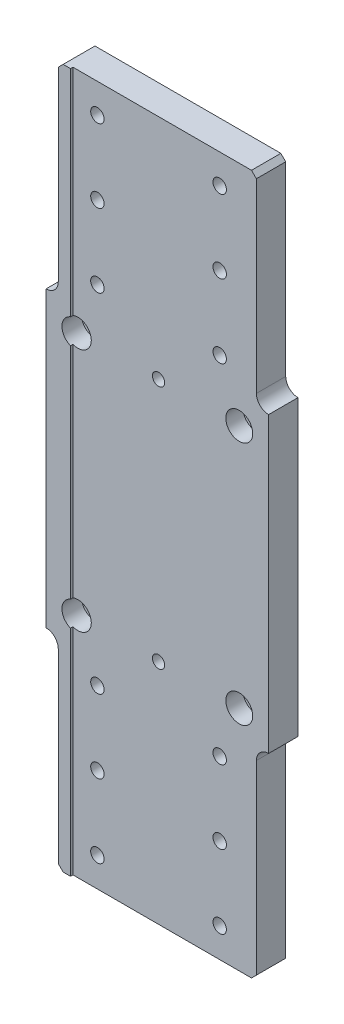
ISO-10303-21;
HEADER;
FILE_DESCRIPTION(('STEP AP214'),'2;1');
FILE_NAME('part.step','',(''),(''),'','','');
FILE_SCHEMA(('AUTOMOTIVE_DESIGN { 1 0 10303 214 1 1 1 1 }'));
ENDSEC;
DATA;
#1=APPLICATION_CONTEXT('core data for automotive mechanical design processes');
#2=APPLICATION_PROTOCOL_DEFINITION('international standard','automotive_design',2000,#1);
#3=PRODUCT_CONTEXT('',#1,'mechanical');
#4=PRODUCT('Part','Part','',(#3));
#5=PRODUCT_RELATED_PRODUCT_CATEGORY('part','',(#4));
#6=PRODUCT_DEFINITION_FORMATION('','',#4);
#7=PRODUCT_DEFINITION_CONTEXT('part definition',#1,'design');
#8=PRODUCT_DEFINITION('design','',#6,#7);
#9=PRODUCT_DEFINITION_SHAPE('','',#8);
#10=(LENGTH_UNIT() NAMED_UNIT(*) SI_UNIT(.MILLI.,.METRE.));
#11=(NAMED_UNIT(*) PLANE_ANGLE_UNIT() SI_UNIT($,.RADIAN.));
#12=(NAMED_UNIT(*) SI_UNIT($,.STERADIAN.) SOLID_ANGLE_UNIT());
#13=UNCERTAINTY_MEASURE_WITH_UNIT(LENGTH_MEASURE(1.E-05),#10,'distance_accuracy_value','');
#14=(GEOMETRIC_REPRESENTATION_CONTEXT(3) GLOBAL_UNCERTAINTY_ASSIGNED_CONTEXT((#13)) GLOBAL_UNIT_ASSIGNED_CONTEXT((#10,
#11,#12)) REPRESENTATION_CONTEXT('',''));
#15=CARTESIAN_POINT('',(0.,0.,0.));
#16=DIRECTION('',(0.,0.,1.));
#17=DIRECTION('',(1.,0.,0.));
#18=AXIS2_PLACEMENT_3D('',#15,#16,#17);
#19=CARTESIAN_POINT('',(0.,0.,-6.5));
#20=DIRECTION('',(0.,0.,-1.));
#21=DIRECTION('',(-1.,0.,0.));
#22=AXIS2_PLACEMENT_3D('',#19,#20,#21);
#23=PLANE('',#22);
#24=CARTESIAN_POINT('',(0.,50.0000000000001,-6.5));
#25=DIRECTION('',(0.,0.,1.));
#26=DIRECTION('',(1.,0.,0.));
#27=AXIS2_PLACEMENT_3D('',#24,#25,#26);
#28=CIRCLE('',#27,2.5);
#29=CARTESIAN_POINT('',(2.5,50.0000000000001,-6.5));
#30=VERTEX_POINT('',#29);
#31=EDGE_CURVE('E593',#30,#30,#28,.T.);
#32=ORIENTED_EDGE('',*,*,#31,.T.);
#33=EDGE_LOOP('',(#32));
#34=FACE_BOUND('',#33,.T.);
#35=CARTESIAN_POINT('',(-33.,50.0000000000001,-6.5));
#36=DIRECTION('',(0.,0.,1.));
#37=DIRECTION('',(1.,0.,0.));
#38=AXIS2_PLACEMENT_3D('',#35,#36,#37);
#39=CIRCLE('',#38,3.3);
#40=CARTESIAN_POINT('',(-29.7,50.0000000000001,-6.5));
#41=VERTEX_POINT('',#40);
#42=EDGE_CURVE('E464',#41,#41,#39,.T.);
#43=ORIENTED_EDGE('',*,*,#42,.T.);
#44=EDGE_LOOP('',(#43));
#45=FACE_BOUND('',#44,.T.);
#46=CARTESIAN_POINT('',(33.,50.0000000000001,-6.5));
#47=DIRECTION('',(0.,0.,1.));
#48=DIRECTION('',(1.,0.,0.));
#49=AXIS2_PLACEMENT_3D('',#46,#47,#48);
#50=CIRCLE('',#49,3.3);
#51=CARTESIAN_POINT('',(36.3,50.0000000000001,-6.5));
#52=VERTEX_POINT('',#51);
#53=EDGE_CURVE('E269',#52,#52,#50,.T.);
#54=ORIENTED_EDGE('',*,*,#53,.T.);
#55=EDGE_LOOP('',(#54));
#56=FACE_BOUND('',#55,.T.);
#57=CARTESIAN_POINT('',(-33.,-49.9999999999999,-6.5));
#58=DIRECTION('',(0.,0.,1.));
#59=DIRECTION('',(1.,0.,0.));
#60=AXIS2_PLACEMENT_3D('',#57,#58,#59);
#61=CIRCLE('',#60,3.3);
#62=CARTESIAN_POINT('',(-29.7,-49.9999999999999,-6.5));
#63=VERTEX_POINT('',#62);
#64=EDGE_CURVE('E445',#63,#63,#61,.T.);
#65=ORIENTED_EDGE('',*,*,#64,.T.);
#66=EDGE_LOOP('',(#65));
#67=FACE_BOUND('',#66,.T.);
#68=CARTESIAN_POINT('',(33.,-49.9999999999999,-6.5));
#69=DIRECTION('',(0.,0.,1.));
#70=DIRECTION('',(1.,0.,0.));
#71=AXIS2_PLACEMENT_3D('',#68,#69,#70);
#72=CIRCLE('',#71,3.3);
#73=CARTESIAN_POINT('',(36.3,-49.9999999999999,-6.5));
#74=VERTEX_POINT('',#73);
#75=EDGE_CURVE('E250',#74,#74,#72,.T.);
#76=ORIENTED_EDGE('',*,*,#75,.T.);
#77=EDGE_LOOP('',(#76));
#78=FACE_BOUND('',#77,.T.);
#79=DIRECTION('',(1.,0.,0.));
#80=VECTOR('',#79,1.);
#81=CARTESIAN_POINT('',(-40.,-143.,-6.5));
#82=LINE('',#81,#80);
#83=CARTESIAN_POINT('',(-38.,-143.,-6.5));
#84=VERTEX_POINT('',#83);
#85=CARTESIAN_POINT('',(38.,-143.,-6.5));
#86=VERTEX_POINT('',#85);
#87=EDGE_CURVE('E410',#84,#86,#82,.T.);
#88=ORIENTED_EDGE('',*,*,#87,.F.);
#89=DIRECTION('',(0.707106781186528,-0.707106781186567,0.));
#90=VECTOR('',#89,1.);
#91=CARTESIAN_POINT('',(-90.500000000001,-90.499999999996,-6.5));
#92=LINE('',#91,#90);
#93=CARTESIAN_POINT('',(-40.,-141.,-6.5));
#94=VERTEX_POINT('',#93);
#95=EDGE_CURVE('E340',#84,#94,#92,.F.);
#96=ORIENTED_EDGE('',*,*,#95,.T.);
#97=DIRECTION('',(0.,-1.,0.));
#98=VECTOR('',#97,1.);
#99=CARTESIAN_POINT('',(-40.,143.,-6.5));
#100=LINE('',#99,#98);
#101=CARTESIAN_POINT('',(-40.,-64.9999999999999,-6.5));
#102=VERTEX_POINT('',#101);
#103=EDGE_CURVE('E384',#102,#94,#100,.T.);
#104=ORIENTED_EDGE('',*,*,#103,.F.);
#105=CARTESIAN_POINT('',(-45.,-64.9999999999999,-6.5));
#106=DIRECTION('',(0.,0.,-1.));
#107=DIRECTION('',(-1.,0.,0.));
#108=AXIS2_PLACEMENT_3D('',#105,#106,#107);
#109=CIRCLE('',#108,5.);
#110=CARTESIAN_POINT('',(-45.,-59.9999999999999,-6.5));
#111=VERTEX_POINT('',#110);
#112=EDGE_CURVE('E317',#102,#111,#109,.F.);
#113=ORIENTED_EDGE('',*,*,#112,.T.);
#114=DIRECTION('',(0.,-1.,0.));
#115=VECTOR('',#114,1.);
#116=CARTESIAN_POINT('',(-45.,60.0000000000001,-6.5));
#117=LINE('',#116,#115);
#118=CARTESIAN_POINT('',(-45.,60.0000000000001,-6.5));
#119=VERTEX_POINT('',#118);
#120=EDGE_CURVE('E395',#119,#111,#117,.T.);
#121=ORIENTED_EDGE('',*,*,#120,.F.);
#122=CARTESIAN_POINT('',(-45.,65.0000000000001,-6.5));
#123=DIRECTION('',(0.,0.,-1.));
#124=DIRECTION('',(-1.,0.,0.));
#125=AXIS2_PLACEMENT_3D('',#122,#123,#124);
#126=CIRCLE('',#125,5.);
#127=CARTESIAN_POINT('',(-40.,65.0000000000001,-6.5));
#128=VERTEX_POINT('',#127);
#129=EDGE_CURVE('E321',#119,#128,#126,.F.);
#130=ORIENTED_EDGE('',*,*,#129,.T.);
#131=CARTESIAN_POINT('',(-40.,141.,-6.5));
#132=VERTEX_POINT('',#131);
#133=EDGE_CURVE('E377',#132,#128,#100,.T.);
#134=ORIENTED_EDGE('',*,*,#133,.F.);
#135=DIRECTION('',(0.707106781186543,0.707106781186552,0.));
#136=VECTOR('',#135,1.);
#137=CARTESIAN_POINT('',(-90.5000000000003,90.4999999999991,-6.5));
#138=LINE('',#137,#136);
#139=CARTESIAN_POINT('',(-38.0000000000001,143.,-6.5));
#140=VERTEX_POINT('',#139);
#141=EDGE_CURVE('E336',#132,#140,#138,.T.);
#142=ORIENTED_EDGE('',*,*,#141,.T.);
#143=DIRECTION('',(1.,0.,0.));
#144=VECTOR('',#143,1.);
#145=CARTESIAN_POINT('',(-40.,143.,-6.5));
#146=LINE('',#145,#144);
#147=CARTESIAN_POINT('',(38.,143.,-6.5));
#148=VERTEX_POINT('',#147);
#149=EDGE_CURVE('E365',#140,#148,#146,.T.);
#150=ORIENTED_EDGE('',*,*,#149,.T.);
#151=DIRECTION('',(-0.707106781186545,0.70710678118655,0.));
#152=VECTOR('',#151,1.);
#153=CARTESIAN_POINT('',(90.5000000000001,90.4999999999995,-6.5));
#154=LINE('',#153,#152);
#155=CARTESIAN_POINT('',(40.,141.,-6.5));
#156=VERTEX_POINT('',#155);
#157=EDGE_CURVE('E334',#148,#156,#154,.F.);
#158=ORIENTED_EDGE('',*,*,#157,.T.);
#159=DIRECTION('',(0.,-1.,0.));
#160=VECTOR('',#159,1.);
#161=CARTESIAN_POINT('',(40.,143.,-6.5));
#162=LINE('',#161,#160);
#163=CARTESIAN_POINT('',(40.,65.0000000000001,-6.5));
#164=VERTEX_POINT('',#163);
#165=EDGE_CURVE('E421',#156,#164,#162,.T.);
#166=ORIENTED_EDGE('',*,*,#165,.T.);
#167=CARTESIAN_POINT('',(45.,65.0000000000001,-6.5));
#168=DIRECTION('',(0.,0.,-1.));
#169=DIRECTION('',(-1.,0.,0.));
#170=AXIS2_PLACEMENT_3D('',#167,#168,#169);
#171=CIRCLE('',#170,5.);
#172=CARTESIAN_POINT('',(45.,60.0000000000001,-6.5));
#173=VERTEX_POINT('',#172);
#174=EDGE_CURVE('E327',#164,#173,#171,.F.);
#175=ORIENTED_EDGE('',*,*,#174,.T.);
#176=DIRECTION('',(0.,-1.,0.));
#177=VECTOR('',#176,1.);
#178=CARTESIAN_POINT('',(45.,60.0000000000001,-6.5));
#179=LINE('',#178,#177);
#180=CARTESIAN_POINT('',(45.,-59.9999999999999,-6.5));
#181=VERTEX_POINT('',#180);
#182=EDGE_CURVE('E396',#173,#181,#179,.T.);
#183=ORIENTED_EDGE('',*,*,#182,.T.);
#184=CARTESIAN_POINT('',(45.,-64.9999999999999,-6.5));
#185=DIRECTION('',(0.,0.,-1.));
#186=DIRECTION('',(-1.,0.,0.));
#187=AXIS2_PLACEMENT_3D('',#184,#185,#186);
#188=CIRCLE('',#187,5.);
#189=CARTESIAN_POINT('',(40.,-64.9999999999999,-6.5));
#190=VERTEX_POINT('',#189);
#191=EDGE_CURVE('E313',#181,#190,#188,.F.);
#192=ORIENTED_EDGE('',*,*,#191,.T.);
#193=CARTESIAN_POINT('',(40.,-141.,-6.5));
#194=VERTEX_POINT('',#193);
#195=EDGE_CURVE('E416',#190,#194,#162,.T.);
#196=ORIENTED_EDGE('',*,*,#195,.T.);
#197=DIRECTION('',(-0.70710678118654,-0.707106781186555,0.));
#198=VECTOR('',#197,1.);
#199=CARTESIAN_POINT('',(90.5000000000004,-90.4999999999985,-6.5));
#200=LINE('',#199,#198);
#201=EDGE_CURVE('E338',#194,#86,#200,.T.);
#202=ORIENTED_EDGE('',*,*,#201,.T.);
#203=EDGE_LOOP('',(#88,#96,#104,#113,#121,#130,#134,#142,#150,#158,#166,#175,#183,#192,#196,#202));
#204=FACE_BOUND('',#203,.T.);
#205=CARTESIAN_POINT('',(-25.,71.0000000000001,-6.5));
#206=DIRECTION('',(0.,0.,-1.));
#207=DIRECTION('',(-1.,0.,0.));
#208=AXIS2_PLACEMENT_3D('',#205,#206,#207);
#209=CIRCLE('',#208,4.75);
#210=CARTESIAN_POINT('',(-29.75,71.0000000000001,-6.5));
#211=VERTEX_POINT('',#210);
#212=EDGE_CURVE('E279',#211,#211,#209,.T.);
#213=ORIENTED_EDGE('',*,*,#212,.F.);
#214=EDGE_LOOP('',(#213));
#215=FACE_BOUND('',#214,.T.);
#216=CARTESIAN_POINT('',(25.,71.0000000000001,-6.5));
#217=DIRECTION('',(0.,0.,-1.));
#218=DIRECTION('',(-1.,0.,0.));
#219=AXIS2_PLACEMENT_3D('',#216,#217,#218);
#220=CIRCLE('',#219,4.75);
#221=CARTESIAN_POINT('',(20.25,71.0000000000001,-6.5));
#222=VERTEX_POINT('',#221);
#223=EDGE_CURVE('E284',#222,#222,#220,.T.);
#224=ORIENTED_EDGE('',*,*,#223,.F.);
#225=EDGE_LOOP('',(#224));
#226=FACE_BOUND('',#225,.T.);
#227=CARTESIAN_POINT('',(-25.,101.,-6.5));
#228=DIRECTION('',(0.,0.,-1.));
#229=DIRECTION('',(-1.,0.,0.));
#230=AXIS2_PLACEMENT_3D('',#227,#228,#229);
#231=CIRCLE('',#230,4.75);
#232=CARTESIAN_POINT('',(-29.75,101.,-6.5));
#233=VERTEX_POINT('',#232);
#234=EDGE_CURVE('E289',#233,#233,#231,.T.);
#235=ORIENTED_EDGE('',*,*,#234,.F.);
#236=EDGE_LOOP('',(#235));
#237=FACE_BOUND('',#236,.T.);
#238=CARTESIAN_POINT('',(25.,101.,-6.5));
#239=DIRECTION('',(0.,0.,-1.));
#240=DIRECTION('',(-1.,0.,0.));
#241=AXIS2_PLACEMENT_3D('',#238,#239,#240);
#242=CIRCLE('',#241,4.75);
#243=CARTESIAN_POINT('',(20.25,101.,-6.5));
#244=VERTEX_POINT('',#243);
#245=EDGE_CURVE('E294',#244,#244,#242,.T.);
#246=ORIENTED_EDGE('',*,*,#245,.F.);
#247=EDGE_LOOP('',(#246));
#248=FACE_BOUND('',#247,.T.);
#249=CARTESIAN_POINT('',(-25.,131.,-6.5));
#250=DIRECTION('',(0.,0.,-1.));
#251=DIRECTION('',(-1.,0.,0.));
#252=AXIS2_PLACEMENT_3D('',#249,#250,#251);
#253=CIRCLE('',#252,4.75);
#254=CARTESIAN_POINT('',(-29.75,131.,-6.5));
#255=VERTEX_POINT('',#254);
#256=EDGE_CURVE('E299',#255,#255,#253,.T.);
#257=ORIENTED_EDGE('',*,*,#256,.F.);
#258=EDGE_LOOP('',(#257));
#259=FACE_BOUND('',#258,.T.);
#260=CARTESIAN_POINT('',(25.,131.,-6.5));
#261=DIRECTION('',(0.,0.,-1.));
#262=DIRECTION('',(-1.,0.,0.));
#263=AXIS2_PLACEMENT_3D('',#260,#261,#262);
#264=CIRCLE('',#263,4.75);
#265=CARTESIAN_POINT('',(20.25,131.,-6.5));
#266=VERTEX_POINT('',#265);
#267=EDGE_CURVE('E512',#266,#266,#264,.T.);
#268=ORIENTED_EDGE('',*,*,#267,.F.);
#269=EDGE_LOOP('',(#268));
#270=FACE_BOUND('',#269,.T.);
#271=CARTESIAN_POINT('',(25.0000000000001,-71.,-6.5));
#272=DIRECTION('',(0.,0.,-1.));
#273=DIRECTION('',(-1.,0.,0.));
#274=AXIS2_PLACEMENT_3D('',#271,#272,#273);
#275=CIRCLE('',#274,4.75);
#276=CARTESIAN_POINT('',(20.2500000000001,-71.,-6.5));
#277=VERTEX_POINT('',#276);
#278=EDGE_CURVE('E524',#277,#277,#275,.T.);
#279=ORIENTED_EDGE('',*,*,#278,.F.);
#280=EDGE_LOOP('',(#279));
#281=FACE_BOUND('',#280,.T.);
#282=CARTESIAN_POINT('',(-25.,-131.,-6.5));
#283=DIRECTION('',(0.,0.,-1.));
#284=DIRECTION('',(-1.,0.,0.));
#285=AXIS2_PLACEMENT_3D('',#282,#283,#284);
#286=CIRCLE('',#285,4.75);
#287=CARTESIAN_POINT('',(-29.75,-131.,-6.5));
#288=VERTEX_POINT('',#287);
#289=EDGE_CURVE('E536',#288,#288,#286,.T.);
#290=ORIENTED_EDGE('',*,*,#289,.F.);
#291=EDGE_LOOP('',(#290));
#292=FACE_BOUND('',#291,.T.);
#293=CARTESIAN_POINT('',(25.,-131.,-6.5));
#294=DIRECTION('',(0.,0.,-1.));
#295=DIRECTION('',(-1.,0.,0.));
#296=AXIS2_PLACEMENT_3D('',#293,#294,#295);
#297=CIRCLE('',#296,4.75);
#298=CARTESIAN_POINT('',(20.25,-131.,-6.5));
#299=VERTEX_POINT('',#298);
#300=EDGE_CURVE('E548',#299,#299,#297,.T.);
#301=ORIENTED_EDGE('',*,*,#300,.F.);
#302=EDGE_LOOP('',(#301));
#303=FACE_BOUND('',#302,.T.);
#304=CARTESIAN_POINT('',(-25.,-101.,-6.5));
#305=DIRECTION('',(0.,0.,-1.));
#306=DIRECTION('',(-1.,0.,0.));
#307=AXIS2_PLACEMENT_3D('',#304,#305,#306);
#308=CIRCLE('',#307,4.75);
#309=CARTESIAN_POINT('',(-29.75,-101.,-6.5));
#310=VERTEX_POINT('',#309);
#311=EDGE_CURVE('E560',#310,#310,#308,.T.);
#312=ORIENTED_EDGE('',*,*,#311,.F.);
#313=EDGE_LOOP('',(#312));
#314=FACE_BOUND('',#313,.T.);
#315=CARTESIAN_POINT('',(25.,-101.,-6.5));
#316=DIRECTION('',(0.,0.,-1.));
#317=DIRECTION('',(-1.,0.,0.));
#318=AXIS2_PLACEMENT_3D('',#315,#316,#317);
#319=CIRCLE('',#318,4.75);
#320=CARTESIAN_POINT('',(20.25,-101.,-6.5));
#321=VERTEX_POINT('',#320);
#322=EDGE_CURVE('E572',#321,#321,#319,.T.);
#323=ORIENTED_EDGE('',*,*,#322,.F.);
#324=EDGE_LOOP('',(#323));
#325=FACE_BOUND('',#324,.T.);
#326=CARTESIAN_POINT('',(-25.,-71.,-6.5));
#327=DIRECTION('',(0.,0.,-1.));
#328=DIRECTION('',(-1.,0.,0.));
#329=AXIS2_PLACEMENT_3D('',#326,#327,#328);
#330=CIRCLE('',#329,4.75);
#331=CARTESIAN_POINT('',(-29.75,-71.,-6.5));
#332=VERTEX_POINT('',#331);
#333=EDGE_CURVE('E584',#332,#332,#330,.T.);
#334=ORIENTED_EDGE('',*,*,#333,.F.);
#335=EDGE_LOOP('',(#334));
#336=FACE_BOUND('',#335,.T.);
#337=CARTESIAN_POINT('',(0.,-49.9999999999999,-6.5));
#338=DIRECTION('',(0.,0.,1.));
#339=DIRECTION('',(1.,0.,0.));
#340=AXIS2_PLACEMENT_3D('',#337,#338,#339);
#341=CIRCLE('',#340,2.5);
#342=CARTESIAN_POINT('',(2.5,-49.9999999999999,-6.5));
#343=VERTEX_POINT('',#342);
#344=EDGE_CURVE('E587',#343,#343,#341,.T.);
#345=ORIENTED_EDGE('',*,*,#344,.T.);
#346=EDGE_LOOP('',(#345));
#347=FACE_BOUND('',#346,.T.);
#348=ADVANCED_FACE('F57',(#34,#45,#56,#67,#78,#204,#215,#226,#237,#248,#259,#270,#281,#292,#303,
#314,#325,#336,#347),#23,.T.);
#349=CARTESIAN_POINT('',(0.,0.,6.5));
#350=DIRECTION('',(0.,0.,-1.));
#351=DIRECTION('',(-1.,0.,0.));
#352=AXIS2_PLACEMENT_3D('',#349,#350,#351);
#353=PLANE('',#352);
#354=DIRECTION('',(0.,-1.,0.));
#355=VECTOR('',#354,1.);
#356=CARTESIAN_POINT('',(-40.,143.,6.5));
#357=LINE('',#356,#355);
#358=CARTESIAN_POINT('',(-40.,-64.9999999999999,6.5));
#359=VERTEX_POINT('',#358);
#360=CARTESIAN_POINT('',(-40.,-141.,6.5));
#361=VERTEX_POINT('',#360);
#362=EDGE_CURVE('E369',#359,#361,#357,.T.);
#363=ORIENTED_EDGE('',*,*,#362,.T.);
#364=DIRECTION('',(-0.707106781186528,0.707106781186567,0.));
#365=VECTOR('',#364,1.);
#366=CARTESIAN_POINT('',(-38.,-143.,6.5));
#367=LINE('',#366,#365);
#368=CARTESIAN_POINT('',(-38.,-143.,6.5));
#369=VERTEX_POINT('',#368);
#370=EDGE_CURVE('E346',#361,#369,#367,.F.);
#371=ORIENTED_EDGE('',*,*,#370,.T.);
#372=DIRECTION('',(1.,0.,0.));
#373=VECTOR('',#372,1.);
#374=CARTESIAN_POINT('',(-40.,-143.,6.5));
#375=LINE('',#374,#373);
#376=CARTESIAN_POINT('',(-35.,-143.,6.5));
#377=VERTEX_POINT('',#376);
#378=EDGE_CURVE('E370',#369,#377,#375,.T.);
#379=ORIENTED_EDGE('',*,*,#378,.T.);
#380=DIRECTION('',(0.,-1.,0.));
#381=VECTOR('',#380,1.);
#382=CARTESIAN_POINT('',(-35.,143.,6.5));
#383=LINE('',#382,#381);
#384=CARTESIAN_POINT('',(-35.,-55.1234753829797,6.5));
#385=VERTEX_POINT('',#384);
#386=EDGE_CURVE('E236',#385,#377,#383,.T.);
#387=ORIENTED_EDGE('',*,*,#386,.F.);
#388=CARTESIAN_POINT('',(-33.,-49.9999999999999,6.5));
#389=DIRECTION('',(0.,0.,1.));
#390=DIRECTION('',(1.,0.,0.));
#391=AXIS2_PLACEMENT_3D('',#388,#389,#390);
#392=CIRCLE('',#391,5.5);
#393=CARTESIAN_POINT('',(-35.,-44.8765246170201,6.5));
#394=VERTEX_POINT('',#393);
#395=EDGE_CURVE('E268',#394,#385,#392,.T.);
#396=ORIENTED_EDGE('',*,*,#395,.F.);
#397=CARTESIAN_POINT('',(-35.,44.8765246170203,6.5));
#398=VERTEX_POINT('',#397);
#399=EDGE_CURVE('E226',#398,#394,#383,.T.);
#400=ORIENTED_EDGE('',*,*,#399,.F.);
#401=CARTESIAN_POINT('',(-33.,50.0000000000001,6.5));
#402=DIRECTION('',(0.,0.,1.));
#403=DIRECTION('',(1.,0.,0.));
#404=AXIS2_PLACEMENT_3D('',#401,#402,#403);
#405=CIRCLE('',#404,5.5);
#406=CARTESIAN_POINT('',(-35.,55.1234753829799,6.5));
#407=VERTEX_POINT('',#406);
#408=EDGE_CURVE('E207',#407,#398,#405,.T.);
#409=ORIENTED_EDGE('',*,*,#408,.F.);
#410=CARTESIAN_POINT('',(-35.,143.,6.5));
#411=VERTEX_POINT('',#410);
#412=EDGE_CURVE('E224',#411,#407,#383,.T.);
#413=ORIENTED_EDGE('',*,*,#412,.F.);
#414=DIRECTION('',(1.,0.,0.));
#415=VECTOR('',#414,1.);
#416=CARTESIAN_POINT('',(-40.,143.,6.5));
#417=LINE('',#416,#415);
#418=CARTESIAN_POINT('',(-38.0000000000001,143.,6.5));
#419=VERTEX_POINT('',#418);
#420=EDGE_CURVE('E363',#419,#411,#417,.T.);
#421=ORIENTED_EDGE('',*,*,#420,.F.);
#422=DIRECTION('',(-0.707106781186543,-0.707106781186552,0.));
#423=VECTOR('',#422,1.);
#424=CARTESIAN_POINT('',(-40.,141.,6.5));
#425=LINE('',#424,#423);
#426=CARTESIAN_POINT('',(-40.,141.,6.5));
#427=VERTEX_POINT('',#426);
#428=EDGE_CURVE('E344',#419,#427,#425,.T.);
#429=ORIENTED_EDGE('',*,*,#428,.T.);
#430=CARTESIAN_POINT('',(-40.,65.0000000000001,6.5));
#431=VERTEX_POINT('',#430);
#432=EDGE_CURVE('E264',#427,#431,#357,.T.);
#433=ORIENTED_EDGE('',*,*,#432,.T.);
#434=CARTESIAN_POINT('',(-45.,65.0000000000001,6.5));
#435=DIRECTION('',(0.,0.,-1.));
#436=DIRECTION('',(-1.,0.,0.));
#437=AXIS2_PLACEMENT_3D('',#434,#435,#436);
#438=CIRCLE('',#437,5.);
#439=CARTESIAN_POINT('',(-45.,60.0000000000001,6.5));
#440=VERTEX_POINT('',#439);
#441=EDGE_CURVE('E319',#431,#440,#438,.T.);
#442=ORIENTED_EDGE('',*,*,#441,.T.);
#443=DIRECTION('',(0.,-1.,0.));
#444=VECTOR('',#443,1.);
#445=CARTESIAN_POINT('',(-45.,60.0000000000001,6.5));
#446=LINE('',#445,#444);
#447=CARTESIAN_POINT('',(-45.,-59.9999999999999,6.5));
#448=VERTEX_POINT('',#447);
#449=EDGE_CURVE('E391',#440,#448,#446,.T.);
#450=ORIENTED_EDGE('',*,*,#449,.T.);
#451=CARTESIAN_POINT('',(-45.,-64.9999999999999,6.5));
#452=DIRECTION('',(0.,0.,-1.));
#453=DIRECTION('',(-1.,0.,0.));
#454=AXIS2_PLACEMENT_3D('',#451,#452,#453);
#455=CIRCLE('',#454,5.);
#456=EDGE_CURVE('E315',#448,#359,#455,.T.);
#457=ORIENTED_EDGE('',*,*,#456,.T.);
#458=EDGE_LOOP('',(#363,#371,#379,#387,#396,#400,#409,#413,#421,#429,#433,#442,#450,#457));
#459=FACE_BOUND('',#458,.T.);
#460=ADVANCED_FACE('F222',(#459),#353,.F.);
#461=CARTESIAN_POINT('',(-35.,143.,5.5));
#462=DIRECTION('',(-1.,0.,0.));
#463=DIRECTION('',(0.,-1.,0.));
#464=AXIS2_PLACEMENT_3D('',#461,#462,#463);
#465=PLANE('',#464);
#466=DIRECTION('',(0.,-1.,0.));
#467=VECTOR('',#466,1.);
#468=CARTESIAN_POINT('',(-35.,143.,5.5));
#469=LINE('',#468,#467);
#470=CARTESIAN_POINT('',(-35.,44.8765246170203,5.5));
#471=VERTEX_POINT('',#470);
#472=CARTESIAN_POINT('',(-35.,-44.8765246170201,5.5));
#473=VERTEX_POINT('',#472);
#474=EDGE_CURVE('E237',#471,#473,#469,.T.);
#475=ORIENTED_EDGE('',*,*,#474,.F.);
#476=DIRECTION('',(0.,0.,1.));
#477=VECTOR('',#476,1.);
#478=CARTESIAN_POINT('',(-35.,44.8765246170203,6.5));
#479=LINE('',#478,#477);
#480=EDGE_CURVE('E215',#471,#398,#479,.T.);
#481=ORIENTED_EDGE('',*,*,#480,.T.);
#482=ORIENTED_EDGE('',*,*,#399,.T.);
#483=DIRECTION('',(0.,0.,1.));
#484=VECTOR('',#483,1.);
#485=CARTESIAN_POINT('',(-35.,-44.8765246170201,6.5));
#486=LINE('',#485,#484);
#487=EDGE_CURVE('E261',#394,#473,#486,.F.);
#488=ORIENTED_EDGE('',*,*,#487,.T.);
#489=EDGE_LOOP('',(#475,#481,#482,#488));
#490=FACE_BOUND('',#489,.T.);
#491=ADVANCED_FACE('F662',(#490),#465,.F.);
#492=CARTESIAN_POINT('',(-35.,-55.1234753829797,5.5));
#493=VERTEX_POINT('',#492);
#494=CARTESIAN_POINT('',(-35.,-143.,5.5));
#495=VERTEX_POINT('',#494);
#496=EDGE_CURVE('E234',#493,#495,#469,.T.);
#497=ORIENTED_EDGE('',*,*,#496,.F.);
#498=DIRECTION('',(0.,0.,1.));
#499=VECTOR('',#498,1.);
#500=CARTESIAN_POINT('',(-35.,-55.1234753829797,6.5));
#501=LINE('',#500,#499);
#502=EDGE_CURVE('E216',#493,#385,#501,.T.);
#503=ORIENTED_EDGE('',*,*,#502,.T.);
#504=ORIENTED_EDGE('',*,*,#386,.T.);
#505=DIRECTION('',(0.,0.,1.));
#506=VECTOR('',#505,1.);
#507=CARTESIAN_POINT('',(-35.,-143.,5.5));
#508=LINE('',#507,#506);
#509=EDGE_CURVE('E428',#495,#377,#508,.T.);
#510=ORIENTED_EDGE('',*,*,#509,.F.);
#511=EDGE_LOOP('',(#497,#503,#504,#510));
#512=FACE_BOUND('',#511,.T.);
#513=ADVANCED_FACE('F677',(#512),#465,.F.);
#514=CARTESIAN_POINT('',(40.,143.,6.5));
#515=DIRECTION('',(1.,0.,0.));
#516=DIRECTION('',(0.,1.,0.));
#517=AXIS2_PLACEMENT_3D('',#514,#515,#516);
#518=PLANE('',#517);
#519=ORIENTED_EDGE('',*,*,#165,.F.);
#520=DIRECTION('',(0.,0.,1.));
#521=VECTOR('',#520,1.);
#522=CARTESIAN_POINT('',(40.,141.,6.5));
#523=LINE('',#522,#521);
#524=CARTESIAN_POINT('',(40.,141.,5.5));
#525=VERTEX_POINT('',#524);
#526=EDGE_CURVE('E12',#156,#525,#523,.T.);
#527=ORIENTED_EDGE('',*,*,#526,.T.);
#528=DIRECTION('',(0.,-1.,0.));
#529=VECTOR('',#528,1.);
#530=CARTESIAN_POINT('',(40.,143.,5.5));
#531=LINE('',#530,#529);
#532=CARTESIAN_POINT('',(40.,65.0000000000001,5.5));
#533=VERTEX_POINT('',#532);
#534=EDGE_CURVE('E399',#525,#533,#531,.T.);
#535=ORIENTED_EDGE('',*,*,#534,.T.);
#536=DIRECTION('',(0.,0.,1.));
#537=VECTOR('',#536,1.);
#538=CARTESIAN_POINT('',(40.,65.0000000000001,-6.5));
#539=LINE('',#538,#537);
#540=EDGE_CURVE('E308',#533,#164,#539,.F.);
#541=ORIENTED_EDGE('',*,*,#540,.T.);
#542=EDGE_LOOP('',(#519,#527,#535,#541));
#543=FACE_BOUND('',#542,.T.);
#544=ADVANCED_FACE('F425',(#543),#518,.T.);
#545=DIRECTION('',(0.,-1.,0.));
#546=VECTOR('',#545,1.);
#547=CARTESIAN_POINT('',(40.,143.,5.5));
#548=LINE('',#547,#546);
#549=CARTESIAN_POINT('',(40.,-64.9999999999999,5.5));
#550=VERTEX_POINT('',#549);
#551=CARTESIAN_POINT('',(40.,-141.,5.5));
#552=VERTEX_POINT('',#551);
#553=EDGE_CURVE('E1351',#550,#552,#548,.T.);
#554=ORIENTED_EDGE('',*,*,#553,.T.);
#555=DIRECTION('',(0.,0.,-1.));
#556=VECTOR('',#555,1.);
#557=CARTESIAN_POINT('',(40.,-141.,-6.5));
#558=LINE('',#557,#556);
#559=EDGE_CURVE('E348',#552,#194,#558,.T.);
#560=ORIENTED_EDGE('',*,*,#559,.T.);
#561=ORIENTED_EDGE('',*,*,#195,.F.);
#562=DIRECTION('',(0.,0.,1.));
#563=VECTOR('',#562,1.);
#564=CARTESIAN_POINT('',(40.,-64.9999999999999,6.5));
#565=LINE('',#564,#563);
#566=EDGE_CURVE('E272',#190,#550,#565,.T.);
#567=ORIENTED_EDGE('',*,*,#566,.T.);
#568=EDGE_LOOP('',(#554,#560,#561,#567));
#569=FACE_BOUND('',#568,.T.);
#570=ADVANCED_FACE('F676',(#569),#518,.T.);
#571=CARTESIAN_POINT('',(45.,60.0000000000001,6.5));
#572=DIRECTION('',(1.,0.,0.));
#573=DIRECTION('',(0.,1.,0.));
#574=AXIS2_PLACEMENT_3D('',#571,#572,#573);
#575=PLANE('',#574);
#576=DIRECTION('',(0.,0.,-1.));
#577=VECTOR('',#576,1.);
#578=CARTESIAN_POINT('',(45.,60.0000000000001,6.5));
#579=LINE('',#578,#577);
#580=CARTESIAN_POINT('',(45.,60.0000000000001,5.5));
#581=VERTEX_POINT('',#580);
#582=EDGE_CURVE('E405',#581,#173,#579,.T.);
#583=ORIENTED_EDGE('',*,*,#582,.F.);
#584=DIRECTION('',(0.,1.,0.));
#585=VECTOR('',#584,1.);
#586=CARTESIAN_POINT('',(45.,143.,5.5));
#587=LINE('',#586,#585);
#588=CARTESIAN_POINT('',(45.,-59.9999999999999,5.5));
#589=VERTEX_POINT('',#588);
#590=EDGE_CURVE('E429',#589,#581,#587,.T.);
#591=ORIENTED_EDGE('',*,*,#590,.F.);
#592=DIRECTION('',(0.,0.,-1.));
#593=VECTOR('',#592,1.);
#594=CARTESIAN_POINT('',(45.,-59.9999999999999,6.5));
#595=LINE('',#594,#593);
#596=EDGE_CURVE('E259',#589,#181,#595,.T.);
#597=ORIENTED_EDGE('',*,*,#596,.T.);
#598=ORIENTED_EDGE('',*,*,#182,.F.);
#599=EDGE_LOOP('',(#583,#591,#597,#598));
#600=FACE_BOUND('',#599,.T.);
#601=ADVANCED_FACE('F673',(#600),#575,.T.);
#602=CARTESIAN_POINT('',(-40.,143.,6.5));
#603=DIRECTION('',(0.,1.,0.));
#604=DIRECTION('',(0.,0.,1.));
#605=AXIS2_PLACEMENT_3D('',#602,#603,#604);
#606=PLANE('',#605);
#607=ORIENTED_EDGE('',*,*,#149,.F.);
#608=DIRECTION('',(0.,0.,1.));
#609=VECTOR('',#608,1.);
#610=CARTESIAN_POINT('',(-38.0000000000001,143.,6.5));
#611=LINE('',#610,#609);
#612=EDGE_CURVE('E65',#140,#419,#611,.T.);
#613=ORIENTED_EDGE('',*,*,#612,.T.);
#614=ORIENTED_EDGE('',*,*,#420,.T.);
#615=DIRECTION('',(0.,0.,1.));
#616=VECTOR('',#615,1.);
#617=CARTESIAN_POINT('',(-35.,143.,5.5));
#618=LINE('',#617,#616);
#619=CARTESIAN_POINT('',(-35.,143.,5.5));
#620=VERTEX_POINT('',#619);
#621=EDGE_CURVE('E233',#620,#411,#618,.T.);
#622=ORIENTED_EDGE('',*,*,#621,.F.);
#623=DIRECTION('',(-1.,0.,0.));
#624=VECTOR('',#623,1.);
#625=CARTESIAN_POINT('',(-35.,143.,5.5));
#626=LINE('',#625,#624);
#627=CARTESIAN_POINT('',(37.9999999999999,143.,5.5));
#628=VERTEX_POINT('',#627);
#629=EDGE_CURVE('E427',#628,#620,#626,.T.);
#630=ORIENTED_EDGE('',*,*,#629,.F.);
#631=DIRECTION('',(0.,0.,-1.));
#632=VECTOR('',#631,1.);
#633=CARTESIAN_POINT('',(38.,143.,6.5));
#634=LINE('',#633,#632);
#635=EDGE_CURVE('E357',#628,#148,#634,.T.);
#636=ORIENTED_EDGE('',*,*,#635,.T.);
#637=EDGE_LOOP('',(#607,#613,#614,#622,#630,#636));
#638=FACE_BOUND('',#637,.T.);
#639=ADVANCED_FACE('F362',(#638),#606,.T.);
#640=CARTESIAN_POINT('',(-40.,143.,6.5));
#641=DIRECTION('',(1.,0.,0.));
#642=DIRECTION('',(0.,1.,0.));
#643=AXIS2_PLACEMENT_3D('',#640,#641,#642);
#644=PLANE('',#643);
#645=ORIENTED_EDGE('',*,*,#432,.F.);
#646=DIRECTION('',(0.,0.,-1.));
#647=VECTOR('',#646,1.);
#648=CARTESIAN_POINT('',(-40.,141.,-6.5));
#649=LINE('',#648,#647);
#650=EDGE_CURVE('E354',#427,#132,#649,.T.);
#651=ORIENTED_EDGE('',*,*,#650,.T.);
#652=ORIENTED_EDGE('',*,*,#133,.T.);
#653=DIRECTION('',(0.,0.,1.));
#654=VECTOR('',#653,1.);
#655=CARTESIAN_POINT('',(-40.,65.0000000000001,6.5));
#656=LINE('',#655,#654);
#657=EDGE_CURVE('E305',#128,#431,#656,.T.);
#658=ORIENTED_EDGE('',*,*,#657,.T.);
#659=EDGE_LOOP('',(#645,#651,#652,#658));
#660=FACE_BOUND('',#659,.T.);
#661=ADVANCED_FACE('F376',(#660),#644,.F.);
#662=CARTESIAN_POINT('',(-40.,-143.,6.5));
#663=DIRECTION('',(0.,1.,0.));
#664=DIRECTION('',(0.,0.,1.));
#665=AXIS2_PLACEMENT_3D('',#662,#663,#664);
#666=PLANE('',#665);
#667=ORIENTED_EDGE('',*,*,#378,.F.);
#668=DIRECTION('',(0.,0.,-1.));
#669=VECTOR('',#668,1.);
#670=CARTESIAN_POINT('',(-38.,-143.,6.5));
#671=LINE('',#670,#669);
#672=EDGE_CURVE('E331',#369,#84,#671,.T.);
#673=ORIENTED_EDGE('',*,*,#672,.T.);
#674=ORIENTED_EDGE('',*,*,#87,.T.);
#675=DIRECTION('',(0.,0.,1.));
#676=VECTOR('',#675,1.);
#677=CARTESIAN_POINT('',(38.,-143.,5.5));
#678=LINE('',#677,#676);
#679=CARTESIAN_POINT('',(38.,-143.,5.5));
#680=VERTEX_POINT('',#679);
#681=EDGE_CURVE('E329',#86,#680,#678,.T.);
#682=ORIENTED_EDGE('',*,*,#681,.T.);
#683=DIRECTION('',(1.,0.,0.));
#684=VECTOR('',#683,1.);
#685=CARTESIAN_POINT('',(-35.,-143.,5.5));
#686=LINE('',#685,#684);
#687=EDGE_CURVE('E432',#495,#680,#686,.T.);
#688=ORIENTED_EDGE('',*,*,#687,.F.);
#689=ORIENTED_EDGE('',*,*,#509,.T.);
#690=EDGE_LOOP('',(#667,#673,#674,#682,#688,#689));
#691=FACE_BOUND('',#690,.T.);
#692=ADVANCED_FACE('F669',(#691),#666,.F.);
#693=ORIENTED_EDGE('',*,*,#103,.T.);
#694=DIRECTION('',(0.,0.,1.));
#695=VECTOR('',#694,1.);
#696=CARTESIAN_POINT('',(-40.,-141.,6.5));
#697=LINE('',#696,#695);
#698=EDGE_CURVE('E342',#94,#361,#697,.T.);
#699=ORIENTED_EDGE('',*,*,#698,.T.);
#700=ORIENTED_EDGE('',*,*,#362,.F.);
#701=DIRECTION('',(0.,0.,1.));
#702=VECTOR('',#701,1.);
#703=CARTESIAN_POINT('',(-40.,-64.9999999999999,-6.5));
#704=LINE('',#703,#702);
#705=EDGE_CURVE('E303',#359,#102,#704,.F.);
#706=ORIENTED_EDGE('',*,*,#705,.T.);
#707=EDGE_LOOP('',(#693,#699,#700,#706));
#708=FACE_BOUND('',#707,.T.);
#709=ADVANCED_FACE('F670',(#708),#644,.F.);
#710=CARTESIAN_POINT('',(-45.,60.0000000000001,6.5));
#711=DIRECTION('',(1.,0.,0.));
#712=DIRECTION('',(0.,1.,0.));
#713=AXIS2_PLACEMENT_3D('',#710,#711,#712);
#714=PLANE('',#713);
#715=ORIENTED_EDGE('',*,*,#120,.T.);
#716=DIRECTION('',(0.,0.,-1.));
#717=VECTOR('',#716,1.);
#718=CARTESIAN_POINT('',(-45.,-59.9999999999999,6.5));
#719=LINE('',#718,#717);
#720=EDGE_CURVE('E394',#448,#111,#719,.T.);
#721=ORIENTED_EDGE('',*,*,#720,.F.);
#722=ORIENTED_EDGE('',*,*,#449,.F.);
#723=DIRECTION('',(0.,0.,-1.));
#724=VECTOR('',#723,1.);
#725=CARTESIAN_POINT('',(-45.,60.0000000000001,6.5));
#726=LINE('',#725,#724);
#727=EDGE_CURVE('E404',#440,#119,#726,.T.);
#728=ORIENTED_EDGE('',*,*,#727,.T.);
#729=EDGE_LOOP('',(#715,#721,#722,#728));
#730=FACE_BOUND('',#729,.T.);
#731=ADVANCED_FACE('F680',(#730),#714,.F.);
#732=ORIENTED_EDGE('',*,*,#412,.T.);
#733=DIRECTION('',(0.,0.,1.));
#734=VECTOR('',#733,1.);
#735=CARTESIAN_POINT('',(-35.,55.1234753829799,6.5));
#736=LINE('',#735,#734);
#737=CARTESIAN_POINT('',(-35.,55.1234753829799,5.5));
#738=VERTEX_POINT('',#737);
#739=EDGE_CURVE('E204',#407,#738,#736,.F.);
#740=ORIENTED_EDGE('',*,*,#739,.T.);
#741=EDGE_CURVE('E239',#620,#738,#469,.T.);
#742=ORIENTED_EDGE('',*,*,#741,.F.);
#743=ORIENTED_EDGE('',*,*,#621,.T.);
#744=EDGE_LOOP('',(#732,#740,#742,#743));
#745=FACE_BOUND('',#744,.T.);
#746=ADVANCED_FACE('F231',(#745),#465,.F.);
#747=CARTESIAN_POINT('',(0.,0.,5.5));
#748=DIRECTION('',(0.,0.,1.));
#749=DIRECTION('',(1.,0.,0.));
#750=AXIS2_PLACEMENT_3D('',#747,#748,#749);
#751=PLANE('',#750);
#752=CARTESIAN_POINT('',(0.,50.0000000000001,5.5));
#753=DIRECTION('',(0.,0.,1.));
#754=DIRECTION('',(1.,0.,0.));
#755=AXIS2_PLACEMENT_3D('',#752,#753,#754);
#756=CIRCLE('',#755,2.49999999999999);
#757=CARTESIAN_POINT('',(2.49999999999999,50.0000000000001,5.5));
#758=VERTEX_POINT('',#757);
#759=EDGE_CURVE('E596',#758,#758,#756,.T.);
#760=ORIENTED_EDGE('',*,*,#759,.F.);
#761=EDGE_LOOP('',(#760));
#762=FACE_BOUND('',#761,.T.);
#763=CARTESIAN_POINT('',(0.,-49.9999999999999,5.5));
#764=DIRECTION('',(0.,0.,1.));
#765=DIRECTION('',(1.,0.,0.));
#766=AXIS2_PLACEMENT_3D('',#763,#764,#765);
#767=CIRCLE('',#766,2.49999999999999);
#768=CARTESIAN_POINT('',(2.49999999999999,-49.9999999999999,5.5));
#769=VERTEX_POINT('',#768);
#770=EDGE_CURVE('E590',#769,#769,#767,.T.);
#771=ORIENTED_EDGE('',*,*,#770,.F.);
#772=EDGE_LOOP('',(#771));
#773=FACE_BOUND('',#772,.T.);
#774=CARTESIAN_POINT('',(-25.,-71.,5.5));
#775=DIRECTION('',(0.,0.,1.));
#776=DIRECTION('',(1.,0.,0.));
#777=AXIS2_PLACEMENT_3D('',#774,#775,#776);
#778=CIRCLE('',#777,2.75);
#779=CARTESIAN_POINT('',(-22.25,-71.,5.5));
#780=VERTEX_POINT('',#779);
#781=EDGE_CURVE('E581',#780,#780,#778,.T.);
#782=ORIENTED_EDGE('',*,*,#781,.F.);
#783=EDGE_LOOP('',(#782));
#784=FACE_BOUND('',#783,.T.);
#785=CARTESIAN_POINT('',(25.,-101.,5.5));
#786=DIRECTION('',(0.,0.,1.));
#787=DIRECTION('',(1.,0.,0.));
#788=AXIS2_PLACEMENT_3D('',#785,#786,#787);
#789=CIRCLE('',#788,2.75);
#790=CARTESIAN_POINT('',(27.75,-101.,5.5));
#791=VERTEX_POINT('',#790);
#792=EDGE_CURVE('E569',#791,#791,#789,.T.);
#793=ORIENTED_EDGE('',*,*,#792,.F.);
#794=EDGE_LOOP('',(#793));
#795=FACE_BOUND('',#794,.T.);
#796=CARTESIAN_POINT('',(-25.,-101.,5.5));
#797=DIRECTION('',(0.,0.,1.));
#798=DIRECTION('',(1.,0.,0.));
#799=AXIS2_PLACEMENT_3D('',#796,#797,#798);
#800=CIRCLE('',#799,2.75);
#801=CARTESIAN_POINT('',(-22.25,-101.,5.5));
#802=VERTEX_POINT('',#801);
#803=EDGE_CURVE('E557',#802,#802,#800,.T.);
#804=ORIENTED_EDGE('',*,*,#803,.F.);
#805=EDGE_LOOP('',(#804));
#806=FACE_BOUND('',#805,.T.);
#807=CARTESIAN_POINT('',(25.,-131.,5.5));
#808=DIRECTION('',(0.,0.,1.));
#809=DIRECTION('',(1.,0.,0.));
#810=AXIS2_PLACEMENT_3D('',#807,#808,#809);
#811=CIRCLE('',#810,2.75);
#812=CARTESIAN_POINT('',(27.75,-131.,5.5));
#813=VERTEX_POINT('',#812);
#814=EDGE_CURVE('E545',#813,#813,#811,.T.);
#815=ORIENTED_EDGE('',*,*,#814,.F.);
#816=EDGE_LOOP('',(#815));
#817=FACE_BOUND('',#816,.T.);
#818=CARTESIAN_POINT('',(-25.,-131.,5.5));
#819=DIRECTION('',(0.,0.,1.));
#820=DIRECTION('',(1.,0.,0.));
#821=AXIS2_PLACEMENT_3D('',#818,#819,#820);
#822=CIRCLE('',#821,2.75);
#823=CARTESIAN_POINT('',(-22.25,-131.,5.5));
#824=VERTEX_POINT('',#823);
#825=EDGE_CURVE('E533',#824,#824,#822,.T.);
#826=ORIENTED_EDGE('',*,*,#825,.F.);
#827=EDGE_LOOP('',(#826));
#828=FACE_BOUND('',#827,.T.);
#829=CARTESIAN_POINT('',(25.0000000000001,-71.,5.5));
#830=DIRECTION('',(0.,0.,1.));
#831=DIRECTION('',(1.,0.,0.));
#832=AXIS2_PLACEMENT_3D('',#829,#830,#831);
#833=CIRCLE('',#832,2.75);
#834=CARTESIAN_POINT('',(27.7500000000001,-71.,5.5));
#835=VERTEX_POINT('',#834);
#836=EDGE_CURVE('E521',#835,#835,#833,.T.);
#837=ORIENTED_EDGE('',*,*,#836,.F.);
#838=EDGE_LOOP('',(#837));
#839=FACE_BOUND('',#838,.T.);
#840=CARTESIAN_POINT('',(25.,131.,5.5));
#841=DIRECTION('',(0.,0.,1.));
#842=DIRECTION('',(1.,0.,0.));
#843=AXIS2_PLACEMENT_3D('',#840,#841,#842);
#844=CIRCLE('',#843,2.75);
#845=CARTESIAN_POINT('',(27.75,131.,5.5));
#846=VERTEX_POINT('',#845);
#847=EDGE_CURVE('E296',#846,#846,#844,.T.);
#848=ORIENTED_EDGE('',*,*,#847,.F.);
#849=EDGE_LOOP('',(#848));
#850=FACE_BOUND('',#849,.T.);
#851=CARTESIAN_POINT('',(-25.,131.,5.5));
#852=DIRECTION('',(0.,0.,1.));
#853=DIRECTION('',(1.,0.,0.));
#854=AXIS2_PLACEMENT_3D('',#851,#852,#853);
#855=CIRCLE('',#854,2.75);
#856=CARTESIAN_POINT('',(-22.25,131.,5.5));
#857=VERTEX_POINT('',#856);
#858=EDGE_CURVE('E291',#857,#857,#855,.T.);
#859=ORIENTED_EDGE('',*,*,#858,.F.);
#860=EDGE_LOOP('',(#859));
#861=FACE_BOUND('',#860,.T.);
#862=CARTESIAN_POINT('',(25.,101.,5.5));
#863=DIRECTION('',(0.,0.,1.));
#864=DIRECTION('',(1.,0.,0.));
#865=AXIS2_PLACEMENT_3D('',#862,#863,#864);
#866=CIRCLE('',#865,2.75);
#867=CARTESIAN_POINT('',(27.75,101.,5.5));
#868=VERTEX_POINT('',#867);
#869=EDGE_CURVE('E286',#868,#868,#866,.T.);
#870=ORIENTED_EDGE('',*,*,#869,.F.);
#871=EDGE_LOOP('',(#870));
#872=FACE_BOUND('',#871,.T.);
#873=CARTESIAN_POINT('',(-25.,101.,5.5));
#874=DIRECTION('',(0.,0.,1.));
#875=DIRECTION('',(1.,0.,0.));
#876=AXIS2_PLACEMENT_3D('',#873,#874,#875);
#877=CIRCLE('',#876,2.75);
#878=CARTESIAN_POINT('',(-22.25,101.,5.5));
#879=VERTEX_POINT('',#878);
#880=EDGE_CURVE('E281',#879,#879,#877,.T.);
#881=ORIENTED_EDGE('',*,*,#880,.F.);
#882=EDGE_LOOP('',(#881));
#883=FACE_BOUND('',#882,.T.);
#884=CARTESIAN_POINT('',(25.,71.0000000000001,5.5));
#885=DIRECTION('',(0.,0.,1.));
#886=DIRECTION('',(1.,0.,0.));
#887=AXIS2_PLACEMENT_3D('',#884,#885,#886);
#888=CIRCLE('',#887,2.75);
#889=CARTESIAN_POINT('',(27.75,71.0000000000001,5.5));
#890=VERTEX_POINT('',#889);
#891=EDGE_CURVE('E276',#890,#890,#888,.T.);
#892=ORIENTED_EDGE('',*,*,#891,.F.);
#893=EDGE_LOOP('',(#892));
#894=FACE_BOUND('',#893,.T.);
#895=CARTESIAN_POINT('',(-25.,71.0000000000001,5.5));
#896=DIRECTION('',(0.,0.,1.));
#897=DIRECTION('',(1.,0.,0.));
#898=AXIS2_PLACEMENT_3D('',#895,#896,#897);
#899=CIRCLE('',#898,2.75);
#900=CARTESIAN_POINT('',(-22.25,71.0000000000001,5.5));
#901=VERTEX_POINT('',#900);
#902=EDGE_CURVE('E228',#901,#901,#899,.T.);
#903=ORIENTED_EDGE('',*,*,#902,.F.);
#904=EDGE_LOOP('',(#903));
#905=FACE_BOUND('',#904,.T.);
#906=ORIENTED_EDGE('',*,*,#687,.T.);
#907=DIRECTION('',(0.70710678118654,0.707106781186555,0.));
#908=VECTOR('',#907,1.);
#909=CARTESIAN_POINT('',(90.5000000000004,-90.4999999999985,5.5));
#910=LINE('',#909,#908);
#911=EDGE_CURVE('E352',#680,#552,#910,.T.);
#912=ORIENTED_EDGE('',*,*,#911,.T.);
#913=ORIENTED_EDGE('',*,*,#553,.F.);
#914=CARTESIAN_POINT('',(45.,-64.9999999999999,5.5));
#915=DIRECTION('',(0.,0.,1.));
#916=DIRECTION('',(1.,0.,0.));
#917=AXIS2_PLACEMENT_3D('',#914,#915,#916);
#918=CIRCLE('',#917,5.);
#919=EDGE_CURVE('E311',#550,#589,#918,.F.);
#920=ORIENTED_EDGE('',*,*,#919,.T.);
#921=ORIENTED_EDGE('',*,*,#590,.T.);
#922=CARTESIAN_POINT('',(45.,65.0000000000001,5.5));
#923=DIRECTION('',(0.,0.,1.));
#924=DIRECTION('',(1.,0.,0.));
#925=AXIS2_PLACEMENT_3D('',#922,#923,#924);
#926=CIRCLE('',#925,5.);
#927=EDGE_CURVE('E324',#581,#533,#926,.F.);
#928=ORIENTED_EDGE('',*,*,#927,.T.);
#929=ORIENTED_EDGE('',*,*,#534,.F.);
#930=DIRECTION('',(0.707106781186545,-0.70710678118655,0.));
#931=VECTOR('',#930,1.);
#932=CARTESIAN_POINT('',(90.5000000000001,90.4999999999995,5.5));
#933=LINE('',#932,#931);
#934=EDGE_CURVE('E72',#525,#628,#933,.F.);
#935=ORIENTED_EDGE('',*,*,#934,.T.);
#936=ORIENTED_EDGE('',*,*,#629,.T.);
#937=ORIENTED_EDGE('',*,*,#741,.T.);
#938=CARTESIAN_POINT('',(-33.,50.0000000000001,5.5));
#939=DIRECTION('',(0.,0.,1.));
#940=DIRECTION('',(1.,0.,0.));
#941=AXIS2_PLACEMENT_3D('',#938,#939,#940);
#942=CIRCLE('',#941,5.5);
#943=EDGE_CURVE('E210',#471,#738,#942,.T.);
#944=ORIENTED_EDGE('',*,*,#943,.F.);
#945=ORIENTED_EDGE('',*,*,#474,.T.);
#946=CARTESIAN_POINT('',(-33.,-49.9999999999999,5.5));
#947=DIRECTION('',(0.,0.,1.));
#948=DIRECTION('',(1.,0.,0.));
#949=AXIS2_PLACEMENT_3D('',#946,#947,#948);
#950=CIRCLE('',#949,5.5);
#951=EDGE_CURVE('E442',#493,#473,#950,.T.);
#952=ORIENTED_EDGE('',*,*,#951,.F.);
#953=ORIENTED_EDGE('',*,*,#496,.T.);
#954=EDGE_LOOP('',(#906,#912,#913,#920,#921,#928,#929,#935,#936,#937,#944,#945,#952,#953));
#955=FACE_BOUND('',#954,.T.);
#956=CARTESIAN_POINT('',(33.,50.0000000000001,5.5));
#957=DIRECTION('',(0.,0.,1.));
#958=DIRECTION('',(1.,0.,0.));
#959=AXIS2_PLACEMENT_3D('',#956,#957,#958);
#960=CIRCLE('',#959,5.5);
#961=CARTESIAN_POINT('',(38.5,50.0000000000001,5.5));
#962=VERTEX_POINT('',#961);
#963=EDGE_CURVE('E266',#962,#962,#960,.T.);
#964=ORIENTED_EDGE('',*,*,#963,.F.);
#965=EDGE_LOOP('',(#964));
#966=FACE_BOUND('',#965,.T.);
#967=CARTESIAN_POINT('',(33.,-49.9999999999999,5.5));
#968=DIRECTION('',(0.,0.,1.));
#969=DIRECTION('',(1.,0.,0.));
#970=AXIS2_PLACEMENT_3D('',#967,#968,#969);
#971=CIRCLE('',#970,5.5);
#972=CARTESIAN_POINT('',(38.5,-49.9999999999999,5.5));
#973=VERTEX_POINT('',#972);
#974=EDGE_CURVE('E243',#973,#973,#971,.T.);
#975=ORIENTED_EDGE('',*,*,#974,.F.);
#976=EDGE_LOOP('',(#975));
#977=FACE_BOUND('',#976,.T.);
#978=ADVANCED_FACE('F602',(#762,#773,#784,#795,#806,#817,#828,#839,#850,#861,#872,#883,#894,
#905,#955,#966,#977),#751,.T.);
#979=CARTESIAN_POINT('',(33.,-49.9999999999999,6.5));
#980=DIRECTION('',(0.,0.,1.));
#981=DIRECTION('',(1.,0.,0.));
#982=AXIS2_PLACEMENT_3D('',#979,#980,#981);
#983=CYLINDRICAL_SURFACE('',#982,3.3);
#984=ORIENTED_EDGE('',*,*,#75,.F.);
#985=EDGE_LOOP('',(#984));
#986=FACE_BOUND('',#985,.T.);
#987=CARTESIAN_POINT('',(33.,-49.9999999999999,-1.5));
#988=DIRECTION('',(0.,0.,1.));
#989=DIRECTION('',(1.,0.,0.));
#990=AXIS2_PLACEMENT_3D('',#987,#988,#989);
#991=CIRCLE('',#990,3.3);
#992=CARTESIAN_POINT('',(36.3,-49.9999999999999,-1.5));
#993=VERTEX_POINT('',#992);
#994=EDGE_CURVE('E255',#993,#993,#991,.T.);
#995=ORIENTED_EDGE('',*,*,#994,.T.);
#996=EDGE_LOOP('',(#995));
#997=FACE_BOUND('',#996,.T.);
#998=ADVANCED_FACE('F605',(#986,#997),#983,.F.);
#999=CARTESIAN_POINT('',(36.3,-49.9999999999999,-1.5));
#1000=DIRECTION('',(0.,0.,-1.));
#1001=DIRECTION('',(-1.,0.,0.));
#1002=AXIS2_PLACEMENT_3D('',#999,#1000,#1001);
#1003=PLANE('',#1002);
#1004=ORIENTED_EDGE('',*,*,#994,.F.);
#1005=EDGE_LOOP('',(#1004));
#1006=FACE_BOUND('',#1005,.T.);
#1007=CARTESIAN_POINT('',(33.,-49.9999999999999,-1.5));
#1008=DIRECTION('',(0.,0.,1.));
#1009=DIRECTION('',(1.,0.,0.));
#1010=AXIS2_PLACEMENT_3D('',#1007,#1008,#1009);
#1011=CIRCLE('',#1010,5.5);
#1012=CARTESIAN_POINT('',(38.5,-49.9999999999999,-1.5));
#1013=VERTEX_POINT('',#1012);
#1014=EDGE_CURVE('E439',#1013,#1013,#1011,.T.);
#1015=ORIENTED_EDGE('',*,*,#1014,.T.);
#1016=EDGE_LOOP('',(#1015));
#1017=FACE_BOUND('',#1016,.T.);
#1018=ADVANCED_FACE('F1293',(#1006,#1017),#1003,.F.);
#1019=CARTESIAN_POINT('',(33.,-49.9999999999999,6.5));
#1020=DIRECTION('',(0.,0.,1.));
#1021=DIRECTION('',(1.,0.,0.));
#1022=AXIS2_PLACEMENT_3D('',#1019,#1020,#1021);
#1023=CYLINDRICAL_SURFACE('',#1022,5.5);
#1024=ORIENTED_EDGE('',*,*,#974,.T.);
#1025=EDGE_LOOP('',(#1024));
#1026=FACE_BOUND('',#1025,.T.);
#1027=ORIENTED_EDGE('',*,*,#1014,.F.);
#1028=EDGE_LOOP('',(#1027));
#1029=FACE_BOUND('',#1028,.T.);
#1030=ADVANCED_FACE('F1283',(#1026,#1029),#1023,.F.);
#1031=CARTESIAN_POINT('',(-33.,-49.9999999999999,6.5));
#1032=DIRECTION('',(0.,0.,1.));
#1033=DIRECTION('',(1.,0.,0.));
#1034=AXIS2_PLACEMENT_3D('',#1031,#1032,#1033);
#1035=CYLINDRICAL_SURFACE('',#1034,5.5);
#1036=CARTESIAN_POINT('',(-33.,-49.9999999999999,-1.5));
#1037=DIRECTION('',(0.,0.,1.));
#1038=DIRECTION('',(1.,0.,0.));
#1039=AXIS2_PLACEMENT_3D('',#1036,#1037,#1038);
#1040=CIRCLE('',#1039,5.5);
#1041=CARTESIAN_POINT('',(-27.5,-49.9999999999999,-1.5));
#1042=VERTEX_POINT('',#1041);
#1043=EDGE_CURVE('E451',#1042,#1042,#1040,.T.);
#1044=ORIENTED_EDGE('',*,*,#1043,.F.);
#1045=EDGE_LOOP('',(#1044));
#1046=FACE_BOUND('',#1045,.T.);
#1047=ORIENTED_EDGE('',*,*,#951,.T.);
#1048=ORIENTED_EDGE('',*,*,#487,.F.);
#1049=ORIENTED_EDGE('',*,*,#395,.T.);
#1050=ORIENTED_EDGE('',*,*,#502,.F.);
#1051=EDGE_LOOP('',(#1047,#1048,#1049,#1050));
#1052=FACE_BOUND('',#1051,.T.);
#1053=ADVANCED_FACE('F1273',(#1046,#1052),#1035,.F.);
#1054=CARTESIAN_POINT('',(-33.,-49.9999999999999,6.5));
#1055=DIRECTION('',(0.,0.,1.));
#1056=DIRECTION('',(1.,0.,0.));
#1057=AXIS2_PLACEMENT_3D('',#1054,#1055,#1056);
#1058=CYLINDRICAL_SURFACE('',#1057,3.3);
#1059=ORIENTED_EDGE('',*,*,#64,.F.);
#1060=EDGE_LOOP('',(#1059));
#1061=FACE_BOUND('',#1060,.T.);
#1062=CARTESIAN_POINT('',(-33.,-49.9999999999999,-1.5));
#1063=DIRECTION('',(0.,0.,1.));
#1064=DIRECTION('',(1.,0.,0.));
#1065=AXIS2_PLACEMENT_3D('',#1062,#1063,#1064);
#1066=CIRCLE('',#1065,3.3);
#1067=CARTESIAN_POINT('',(-29.7,-49.9999999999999,-1.5));
#1068=VERTEX_POINT('',#1067);
#1069=EDGE_CURVE('E448',#1068,#1068,#1066,.T.);
#1070=ORIENTED_EDGE('',*,*,#1069,.T.);
#1071=EDGE_LOOP('',(#1070));
#1072=FACE_BOUND('',#1071,.T.);
#1073=ADVANCED_FACE('F1263',(#1061,#1072),#1058,.F.);
#1074=CARTESIAN_POINT('',(-29.7,-49.9999999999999,-1.5));
#1075=DIRECTION('',(0.,0.,-1.));
#1076=DIRECTION('',(-1.,0.,0.));
#1077=AXIS2_PLACEMENT_3D('',#1074,#1075,#1076);
#1078=PLANE('',#1077);
#1079=ORIENTED_EDGE('',*,*,#1069,.F.);
#1080=EDGE_LOOP('',(#1079));
#1081=FACE_BOUND('',#1080,.T.);
#1082=ORIENTED_EDGE('',*,*,#1043,.T.);
#1083=EDGE_LOOP('',(#1082));
#1084=FACE_BOUND('',#1083,.T.);
#1085=ADVANCED_FACE('F652',(#1081,#1084),#1078,.F.);
#1086=CARTESIAN_POINT('',(33.,50.0000000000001,6.5));
#1087=DIRECTION('',(0.,0.,1.));
#1088=DIRECTION('',(1.,0.,0.));
#1089=AXIS2_PLACEMENT_3D('',#1086,#1087,#1088);
#1090=CYLINDRICAL_SURFACE('',#1089,3.3);
#1091=ORIENTED_EDGE('',*,*,#53,.F.);
#1092=EDGE_LOOP('',(#1091));
#1093=FACE_BOUND('',#1092,.T.);
#1094=CARTESIAN_POINT('',(33.,50.0000000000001,-1.5));
#1095=DIRECTION('',(0.,0.,1.));
#1096=DIRECTION('',(1.,0.,0.));
#1097=AXIS2_PLACEMENT_3D('',#1094,#1095,#1096);
#1098=CIRCLE('',#1097,3.3);
#1099=CARTESIAN_POINT('',(36.3,50.0000000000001,-1.5));
#1100=VERTEX_POINT('',#1099);
#1101=EDGE_CURVE('E457',#1100,#1100,#1098,.T.);
#1102=ORIENTED_EDGE('',*,*,#1101,.T.);
#1103=EDGE_LOOP('',(#1102));
#1104=FACE_BOUND('',#1103,.T.);
#1105=ADVANCED_FACE('F646',(#1093,#1104),#1090,.F.);
#1106=CARTESIAN_POINT('',(36.3,50.0000000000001,-1.5));
#1107=DIRECTION('',(0.,0.,-1.));
#1108=DIRECTION('',(-1.,0.,0.));
#1109=AXIS2_PLACEMENT_3D('',#1106,#1107,#1108);
#1110=PLANE('',#1109);
#1111=ORIENTED_EDGE('',*,*,#1101,.F.);
#1112=EDGE_LOOP('',(#1111));
#1113=FACE_BOUND('',#1112,.T.);
#1114=CARTESIAN_POINT('',(33.,50.0000000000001,-1.5));
#1115=DIRECTION('',(0.,0.,1.));
#1116=DIRECTION('',(1.,0.,0.));
#1117=AXIS2_PLACEMENT_3D('',#1114,#1115,#1116);
#1118=CIRCLE('',#1117,5.5);
#1119=CARTESIAN_POINT('',(38.5,50.0000000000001,-1.5));
#1120=VERTEX_POINT('',#1119);
#1121=EDGE_CURVE('E460',#1120,#1120,#1118,.T.);
#1122=ORIENTED_EDGE('',*,*,#1121,.T.);
#1123=EDGE_LOOP('',(#1122));
#1124=FACE_BOUND('',#1123,.T.);
#1125=ADVANCED_FACE('F641',(#1113,#1124),#1110,.F.);
#1126=CARTESIAN_POINT('',(33.,50.0000000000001,6.5));
#1127=DIRECTION('',(0.,0.,1.));
#1128=DIRECTION('',(1.,0.,0.));
#1129=AXIS2_PLACEMENT_3D('',#1126,#1127,#1128);
#1130=CYLINDRICAL_SURFACE('',#1129,5.5);
#1131=ORIENTED_EDGE('',*,*,#963,.T.);
#1132=EDGE_LOOP('',(#1131));
#1133=FACE_BOUND('',#1132,.T.);
#1134=ORIENTED_EDGE('',*,*,#1121,.F.);
#1135=EDGE_LOOP('',(#1134));
#1136=FACE_BOUND('',#1135,.T.);
#1137=ADVANCED_FACE('F638',(#1133,#1136),#1130,.F.);
#1138=CARTESIAN_POINT('',(-33.,50.0000000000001,6.5));
#1139=DIRECTION('',(0.,0.,1.));
#1140=DIRECTION('',(1.,0.,0.));
#1141=AXIS2_PLACEMENT_3D('',#1138,#1139,#1140);
#1142=CYLINDRICAL_SURFACE('',#1141,5.5);
#1143=CARTESIAN_POINT('',(-33.,50.0000000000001,-1.5));
#1144=DIRECTION('',(0.,0.,1.));
#1145=DIRECTION('',(1.,0.,0.));
#1146=AXIS2_PLACEMENT_3D('',#1143,#1144,#1145);
#1147=CIRCLE('',#1146,5.5);
#1148=CARTESIAN_POINT('',(-27.5,50.0000000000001,-1.5));
#1149=VERTEX_POINT('',#1148);
#1150=EDGE_CURVE('E227',#1149,#1149,#1147,.T.);
#1151=ORIENTED_EDGE('',*,*,#1150,.F.);
#1152=EDGE_LOOP('',(#1151));
#1153=FACE_BOUND('',#1152,.T.);
#1154=ORIENTED_EDGE('',*,*,#943,.T.);
#1155=ORIENTED_EDGE('',*,*,#739,.F.);
#1156=ORIENTED_EDGE('',*,*,#408,.T.);
#1157=ORIENTED_EDGE('',*,*,#480,.F.);
#1158=EDGE_LOOP('',(#1154,#1155,#1156,#1157));
#1159=FACE_BOUND('',#1158,.T.);
#1160=ADVANCED_FACE('F206',(#1153,#1159),#1142,.F.);
#1161=CARTESIAN_POINT('',(-33.,50.0000000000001,6.5));
#1162=DIRECTION('',(0.,0.,1.));
#1163=DIRECTION('',(1.,0.,0.));
#1164=AXIS2_PLACEMENT_3D('',#1161,#1162,#1163);
#1165=CYLINDRICAL_SURFACE('',#1164,3.3);
#1166=ORIENTED_EDGE('',*,*,#42,.F.);
#1167=EDGE_LOOP('',(#1166));
#1168=FACE_BOUND('',#1167,.T.);
#1169=CARTESIAN_POINT('',(-33.,50.0000000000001,-1.5));
#1170=DIRECTION('',(0.,0.,1.));
#1171=DIRECTION('',(1.,0.,0.));
#1172=AXIS2_PLACEMENT_3D('',#1169,#1170,#1171);
#1173=CIRCLE('',#1172,3.3);
#1174=CARTESIAN_POINT('',(-29.7,50.0000000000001,-1.5));
#1175=VERTEX_POINT('',#1174);
#1176=EDGE_CURVE('E467',#1175,#1175,#1173,.T.);
#1177=ORIENTED_EDGE('',*,*,#1176,.T.);
#1178=EDGE_LOOP('',(#1177));
#1179=FACE_BOUND('',#1178,.T.);
#1180=ADVANCED_FACE('F1219',(#1168,#1179),#1165,.F.);
#1181=CARTESIAN_POINT('',(-29.7,50.0000000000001,-1.5));
#1182=DIRECTION('',(0.,0.,-1.));
#1183=DIRECTION('',(-1.,0.,0.));
#1184=AXIS2_PLACEMENT_3D('',#1181,#1182,#1183);
#1185=PLANE('',#1184);
#1186=ORIENTED_EDGE('',*,*,#1176,.F.);
#1187=EDGE_LOOP('',(#1186));
#1188=FACE_BOUND('',#1187,.T.);
#1189=ORIENTED_EDGE('',*,*,#1150,.T.);
#1190=EDGE_LOOP('',(#1189));
#1191=FACE_BOUND('',#1190,.T.);
#1192=ADVANCED_FACE('F1209',(#1188,#1191),#1185,.F.);
#1193=CARTESIAN_POINT('',(-25.,71.0000000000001,-6.5));
#1194=DIRECTION('',(0.,0.,-1.));
#1195=DIRECTION('',(-1.,0.,0.));
#1196=AXIS2_PLACEMENT_3D('',#1193,#1194,#1195);
#1197=CYLINDRICAL_SURFACE('',#1196,2.75);
#1198=ORIENTED_EDGE('',*,*,#902,.T.);
#1199=EDGE_LOOP('',(#1198));
#1200=FACE_BOUND('',#1199,.T.);
#1201=CARTESIAN_POINT('',(-25.,71.0000000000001,0.5));
#1202=DIRECTION('',(0.,0.,-1.));
#1203=DIRECTION('',(-1.,0.,0.));
#1204=AXIS2_PLACEMENT_3D('',#1201,#1202,#1203);
#1205=CIRCLE('',#1204,2.75);
#1206=CARTESIAN_POINT('',(-27.75,71.0000000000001,0.5));
#1207=VERTEX_POINT('',#1206);
#1208=EDGE_CURVE('E275',#1207,#1207,#1205,.T.);
#1209=ORIENTED_EDGE('',*,*,#1208,.T.);
#1210=EDGE_LOOP('',(#1209));
#1211=FACE_BOUND('',#1210,.T.);
#1212=ADVANCED_FACE('F1199',(#1200,#1211),#1197,.F.);
#1213=CARTESIAN_POINT('',(-22.25,71.0000000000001,0.5));
#1214=DIRECTION('',(0.,0.,1.));
#1215=DIRECTION('',(1.,0.,0.));
#1216=AXIS2_PLACEMENT_3D('',#1213,#1214,#1215);
#1217=PLANE('',#1216);
#1218=ORIENTED_EDGE('',*,*,#1208,.F.);
#1219=EDGE_LOOP('',(#1218));
#1220=FACE_BOUND('',#1219,.T.);
#1221=CARTESIAN_POINT('',(-25.,71.0000000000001,0.5));
#1222=DIRECTION('',(0.,0.,-1.));
#1223=DIRECTION('',(-1.,0.,0.));
#1224=AXIS2_PLACEMENT_3D('',#1221,#1222,#1223);
#1225=CIRCLE('',#1224,4.75);
#1226=CARTESIAN_POINT('',(-29.75,71.0000000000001,0.5));
#1227=VERTEX_POINT('',#1226);
#1228=EDGE_CURVE('E474',#1227,#1227,#1225,.T.);
#1229=ORIENTED_EDGE('',*,*,#1228,.T.);
#1230=EDGE_LOOP('',(#1229));
#1231=FACE_BOUND('',#1230,.T.);
#1232=ADVANCED_FACE('F1189',(#1220,#1231),#1217,.F.);
#1233=CARTESIAN_POINT('',(-25.,71.0000000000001,-6.5));
#1234=DIRECTION('',(0.,0.,-1.));
#1235=DIRECTION('',(-1.,0.,0.));
#1236=AXIS2_PLACEMENT_3D('',#1233,#1234,#1235);
#1237=CYLINDRICAL_SURFACE('',#1236,4.75);
#1238=ORIENTED_EDGE('',*,*,#1228,.F.);
#1239=EDGE_LOOP('',(#1238));
#1240=FACE_BOUND('',#1239,.T.);
#1241=ORIENTED_EDGE('',*,*,#212,.T.);
#1242=EDGE_LOOP('',(#1241));
#1243=FACE_BOUND('',#1242,.T.);
#1244=ADVANCED_FACE('F1179',(#1240,#1243),#1237,.F.);
#1245=CARTESIAN_POINT('',(25.,71.0000000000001,-6.5));
#1246=DIRECTION('',(0.,0.,-1.));
#1247=DIRECTION('',(-1.,0.,0.));
#1248=AXIS2_PLACEMENT_3D('',#1245,#1246,#1247);
#1249=CYLINDRICAL_SURFACE('',#1248,2.75);
#1250=ORIENTED_EDGE('',*,*,#891,.T.);
#1251=EDGE_LOOP('',(#1250));
#1252=FACE_BOUND('',#1251,.T.);
#1253=CARTESIAN_POINT('',(25.,71.0000000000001,0.5));
#1254=DIRECTION('',(0.,0.,-1.));
#1255=DIRECTION('',(-1.,0.,0.));
#1256=AXIS2_PLACEMENT_3D('',#1253,#1254,#1255);
#1257=CIRCLE('',#1256,2.75);
#1258=CARTESIAN_POINT('',(22.25,71.0000000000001,0.5));
#1259=VERTEX_POINT('',#1258);
#1260=EDGE_CURVE('E280',#1259,#1259,#1257,.T.);
#1261=ORIENTED_EDGE('',*,*,#1260,.T.);
#1262=EDGE_LOOP('',(#1261));
#1263=FACE_BOUND('',#1262,.T.);
#1264=ADVANCED_FACE('F1169',(#1252,#1263),#1249,.F.);
#1265=CARTESIAN_POINT('',(27.75,71.0000000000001,0.5));
#1266=DIRECTION('',(0.,0.,1.));
#1267=DIRECTION('',(1.,0.,0.));
#1268=AXIS2_PLACEMENT_3D('',#1265,#1266,#1267);
#1269=PLANE('',#1268);
#1270=ORIENTED_EDGE('',*,*,#1260,.F.);
#1271=EDGE_LOOP('',(#1270));
#1272=FACE_BOUND('',#1271,.T.);
#1273=CARTESIAN_POINT('',(25.,71.0000000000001,0.5));
#1274=DIRECTION('',(0.,0.,-1.));
#1275=DIRECTION('',(-1.,0.,0.));
#1276=AXIS2_PLACEMENT_3D('',#1273,#1274,#1275);
#1277=CIRCLE('',#1276,4.75);
#1278=CARTESIAN_POINT('',(20.25,71.0000000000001,0.5));
#1279=VERTEX_POINT('',#1278);
#1280=EDGE_CURVE('E481',#1279,#1279,#1277,.T.);
#1281=ORIENTED_EDGE('',*,*,#1280,.T.);
#1282=EDGE_LOOP('',(#1281));
#1283=FACE_BOUND('',#1282,.T.);
#1284=ADVANCED_FACE('F1159',(#1272,#1283),#1269,.F.);
#1285=CARTESIAN_POINT('',(25.,71.0000000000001,-6.5));
#1286=DIRECTION('',(0.,0.,-1.));
#1287=DIRECTION('',(-1.,0.,0.));
#1288=AXIS2_PLACEMENT_3D('',#1285,#1286,#1287);
#1289=CYLINDRICAL_SURFACE('',#1288,4.75);
#1290=ORIENTED_EDGE('',*,*,#1280,.F.);
#1291=EDGE_LOOP('',(#1290));
#1292=FACE_BOUND('',#1291,.T.);
#1293=ORIENTED_EDGE('',*,*,#223,.T.);
#1294=EDGE_LOOP('',(#1293));
#1295=FACE_BOUND('',#1294,.T.);
#1296=ADVANCED_FACE('F1149',(#1292,#1295),#1289,.F.);
#1297=CARTESIAN_POINT('',(-25.,101.,-6.5));
#1298=DIRECTION('',(0.,0.,-1.));
#1299=DIRECTION('',(-1.,0.,0.));
#1300=AXIS2_PLACEMENT_3D('',#1297,#1298,#1299);
#1301=CYLINDRICAL_SURFACE('',#1300,2.75);
#1302=ORIENTED_EDGE('',*,*,#880,.T.);
#1303=EDGE_LOOP('',(#1302));
#1304=FACE_BOUND('',#1303,.T.);
#1305=CARTESIAN_POINT('',(-25.,101.,0.5));
#1306=DIRECTION('',(0.,0.,-1.));
#1307=DIRECTION('',(-1.,0.,0.));
#1308=AXIS2_PLACEMENT_3D('',#1305,#1306,#1307);
#1309=CIRCLE('',#1308,2.75);
#1310=CARTESIAN_POINT('',(-27.75,101.,0.5));
#1311=VERTEX_POINT('',#1310);
#1312=EDGE_CURVE('E285',#1311,#1311,#1309,.T.);
#1313=ORIENTED_EDGE('',*,*,#1312,.T.);
#1314=EDGE_LOOP('',(#1313));
#1315=FACE_BOUND('',#1314,.T.);
#1316=ADVANCED_FACE('F1139',(#1304,#1315),#1301,.F.);
#1317=CARTESIAN_POINT('',(-22.25,101.,0.5));
#1318=DIRECTION('',(0.,0.,1.));
#1319=DIRECTION('',(1.,0.,0.));
#1320=AXIS2_PLACEMENT_3D('',#1317,#1318,#1319);
#1321=PLANE('',#1320);
#1322=ORIENTED_EDGE('',*,*,#1312,.F.);
#1323=EDGE_LOOP('',(#1322));
#1324=FACE_BOUND('',#1323,.T.);
#1325=CARTESIAN_POINT('',(-25.,101.,0.5));
#1326=DIRECTION('',(0.,0.,-1.));
#1327=DIRECTION('',(-1.,0.,0.));
#1328=AXIS2_PLACEMENT_3D('',#1325,#1326,#1327);
#1329=CIRCLE('',#1328,4.75);
#1330=CARTESIAN_POINT('',(-29.75,101.,0.5));
#1331=VERTEX_POINT('',#1330);
#1332=EDGE_CURVE('E488',#1331,#1331,#1329,.T.);
#1333=ORIENTED_EDGE('',*,*,#1332,.T.);
#1334=EDGE_LOOP('',(#1333));
#1335=FACE_BOUND('',#1334,.T.);
#1336=ADVANCED_FACE('F1129',(#1324,#1335),#1321,.F.);
#1337=CARTESIAN_POINT('',(-25.,101.,-6.5));
#1338=DIRECTION('',(0.,0.,-1.));
#1339=DIRECTION('',(-1.,0.,0.));
#1340=AXIS2_PLACEMENT_3D('',#1337,#1338,#1339);
#1341=CYLINDRICAL_SURFACE('',#1340,4.75);
#1342=ORIENTED_EDGE('',*,*,#1332,.F.);
#1343=EDGE_LOOP('',(#1342));
#1344=FACE_BOUND('',#1343,.T.);
#1345=ORIENTED_EDGE('',*,*,#234,.T.);
#1346=EDGE_LOOP('',(#1345));
#1347=FACE_BOUND('',#1346,.T.);
#1348=ADVANCED_FACE('F1119',(#1344,#1347),#1341,.F.);
#1349=CARTESIAN_POINT('',(25.,101.,-6.5));
#1350=DIRECTION('',(0.,0.,-1.));
#1351=DIRECTION('',(-1.,0.,0.));
#1352=AXIS2_PLACEMENT_3D('',#1349,#1350,#1351);
#1353=CYLINDRICAL_SURFACE('',#1352,2.75);
#1354=ORIENTED_EDGE('',*,*,#869,.T.);
#1355=EDGE_LOOP('',(#1354));
#1356=FACE_BOUND('',#1355,.T.);
#1357=CARTESIAN_POINT('',(25.,101.,0.5));
#1358=DIRECTION('',(0.,0.,-1.));
#1359=DIRECTION('',(-1.,0.,0.));
#1360=AXIS2_PLACEMENT_3D('',#1357,#1358,#1359);
#1361=CIRCLE('',#1360,2.75);
#1362=CARTESIAN_POINT('',(22.25,101.,0.5));
#1363=VERTEX_POINT('',#1362);
#1364=EDGE_CURVE('E290',#1363,#1363,#1361,.T.);
#1365=ORIENTED_EDGE('',*,*,#1364,.T.);
#1366=EDGE_LOOP('',(#1365));
#1367=FACE_BOUND('',#1366,.T.);
#1368=ADVANCED_FACE('F1109',(#1356,#1367),#1353,.F.);
#1369=CARTESIAN_POINT('',(27.75,101.,0.5));
#1370=DIRECTION('',(0.,0.,1.));
#1371=DIRECTION('',(1.,0.,0.));
#1372=AXIS2_PLACEMENT_3D('',#1369,#1370,#1371);
#1373=PLANE('',#1372);
#1374=ORIENTED_EDGE('',*,*,#1364,.F.);
#1375=EDGE_LOOP('',(#1374));
#1376=FACE_BOUND('',#1375,.T.);
#1377=CARTESIAN_POINT('',(25.,101.,0.5));
#1378=DIRECTION('',(0.,0.,-1.));
#1379=DIRECTION('',(-1.,0.,0.));
#1380=AXIS2_PLACEMENT_3D('',#1377,#1378,#1379);
#1381=CIRCLE('',#1380,4.75);
#1382=CARTESIAN_POINT('',(20.25,101.,0.5));
#1383=VERTEX_POINT('',#1382);
#1384=EDGE_CURVE('E495',#1383,#1383,#1381,.T.);
#1385=ORIENTED_EDGE('',*,*,#1384,.T.);
#1386=EDGE_LOOP('',(#1385));
#1387=FACE_BOUND('',#1386,.T.);
#1388=ADVANCED_FACE('F1099',(#1376,#1387),#1373,.F.);
#1389=CARTESIAN_POINT('',(25.,101.,-6.5));
#1390=DIRECTION('',(0.,0.,-1.));
#1391=DIRECTION('',(-1.,0.,0.));
#1392=AXIS2_PLACEMENT_3D('',#1389,#1390,#1391);
#1393=CYLINDRICAL_SURFACE('',#1392,4.75);
#1394=ORIENTED_EDGE('',*,*,#1384,.F.);
#1395=EDGE_LOOP('',(#1394));
#1396=FACE_BOUND('',#1395,.T.);
#1397=ORIENTED_EDGE('',*,*,#245,.T.);
#1398=EDGE_LOOP('',(#1397));
#1399=FACE_BOUND('',#1398,.T.);
#1400=ADVANCED_FACE('F1089',(#1396,#1399),#1393,.F.);
#1401=CARTESIAN_POINT('',(-25.,131.,-6.5));
#1402=DIRECTION('',(0.,0.,-1.));
#1403=DIRECTION('',(-1.,0.,0.));
#1404=AXIS2_PLACEMENT_3D('',#1401,#1402,#1403);
#1405=CYLINDRICAL_SURFACE('',#1404,2.75);
#1406=ORIENTED_EDGE('',*,*,#858,.T.);
#1407=EDGE_LOOP('',(#1406));
#1408=FACE_BOUND('',#1407,.T.);
#1409=CARTESIAN_POINT('',(-25.,131.,0.5));
#1410=DIRECTION('',(0.,0.,-1.));
#1411=DIRECTION('',(-1.,0.,0.));
#1412=AXIS2_PLACEMENT_3D('',#1409,#1410,#1411);
#1413=CIRCLE('',#1412,2.75);
#1414=CARTESIAN_POINT('',(-27.75,131.,0.5));
#1415=VERTEX_POINT('',#1414);
#1416=EDGE_CURVE('E295',#1415,#1415,#1413,.T.);
#1417=ORIENTED_EDGE('',*,*,#1416,.T.);
#1418=EDGE_LOOP('',(#1417));
#1419=FACE_BOUND('',#1418,.T.);
#1420=ADVANCED_FACE('F1079',(#1408,#1419),#1405,.F.);
#1421=CARTESIAN_POINT('',(-22.25,131.,0.5));
#1422=DIRECTION('',(0.,0.,1.));
#1423=DIRECTION('',(1.,0.,0.));
#1424=AXIS2_PLACEMENT_3D('',#1421,#1422,#1423);
#1425=PLANE('',#1424);
#1426=ORIENTED_EDGE('',*,*,#1416,.F.);
#1427=EDGE_LOOP('',(#1426));
#1428=FACE_BOUND('',#1427,.T.);
#1429=CARTESIAN_POINT('',(-25.,131.,0.5));
#1430=DIRECTION('',(0.,0.,-1.));
#1431=DIRECTION('',(-1.,0.,0.));
#1432=AXIS2_PLACEMENT_3D('',#1429,#1430,#1431);
#1433=CIRCLE('',#1432,4.75);
#1434=CARTESIAN_POINT('',(-29.75,131.,0.5));
#1435=VERTEX_POINT('',#1434);
#1436=EDGE_CURVE('E502',#1435,#1435,#1433,.T.);
#1437=ORIENTED_EDGE('',*,*,#1436,.T.);
#1438=EDGE_LOOP('',(#1437));
#1439=FACE_BOUND('',#1438,.T.);
#1440=ADVANCED_FACE('F1069',(#1428,#1439),#1425,.F.);
#1441=CARTESIAN_POINT('',(-25.,131.,-6.5));
#1442=DIRECTION('',(0.,0.,-1.));
#1443=DIRECTION('',(-1.,0.,0.));
#1444=AXIS2_PLACEMENT_3D('',#1441,#1442,#1443);
#1445=CYLINDRICAL_SURFACE('',#1444,4.75);
#1446=ORIENTED_EDGE('',*,*,#1436,.F.);
#1447=EDGE_LOOP('',(#1446));
#1448=FACE_BOUND('',#1447,.T.);
#1449=ORIENTED_EDGE('',*,*,#256,.T.);
#1450=EDGE_LOOP('',(#1449));
#1451=FACE_BOUND('',#1450,.T.);
#1452=ADVANCED_FACE('F1059',(#1448,#1451),#1445,.F.);
#1453=CARTESIAN_POINT('',(25.,131.,-6.5));
#1454=DIRECTION('',(0.,0.,-1.));
#1455=DIRECTION('',(-1.,0.,0.));
#1456=AXIS2_PLACEMENT_3D('',#1453,#1454,#1455);
#1457=CYLINDRICAL_SURFACE('',#1456,2.75);
#1458=ORIENTED_EDGE('',*,*,#847,.T.);
#1459=EDGE_LOOP('',(#1458));
#1460=FACE_BOUND('',#1459,.T.);
#1461=CARTESIAN_POINT('',(25.,131.,0.5));
#1462=DIRECTION('',(0.,0.,-1.));
#1463=DIRECTION('',(-1.,0.,0.));
#1464=AXIS2_PLACEMENT_3D('',#1461,#1462,#1463);
#1465=CIRCLE('',#1464,2.75);
#1466=CARTESIAN_POINT('',(22.25,131.,0.5));
#1467=VERTEX_POINT('',#1466);
#1468=EDGE_CURVE('E300',#1467,#1467,#1465,.T.);
#1469=ORIENTED_EDGE('',*,*,#1468,.T.);
#1470=EDGE_LOOP('',(#1469));
#1471=FACE_BOUND('',#1470,.T.);
#1472=ADVANCED_FACE('F1049',(#1460,#1471),#1457,.F.);
#1473=CARTESIAN_POINT('',(27.75,131.,0.5));
#1474=DIRECTION('',(0.,0.,1.));
#1475=DIRECTION('',(1.,0.,0.));
#1476=AXIS2_PLACEMENT_3D('',#1473,#1474,#1475);
#1477=PLANE('',#1476);
#1478=ORIENTED_EDGE('',*,*,#1468,.F.);
#1479=EDGE_LOOP('',(#1478));
#1480=FACE_BOUND('',#1479,.T.);
#1481=CARTESIAN_POINT('',(25.,131.,0.5));
#1482=DIRECTION('',(0.,0.,-1.));
#1483=DIRECTION('',(-1.,0.,0.));
#1484=AXIS2_PLACEMENT_3D('',#1481,#1482,#1483);
#1485=CIRCLE('',#1484,4.75);
#1486=CARTESIAN_POINT('',(20.25,131.,0.5));
#1487=VERTEX_POINT('',#1486);
#1488=EDGE_CURVE('E509',#1487,#1487,#1485,.T.);
#1489=ORIENTED_EDGE('',*,*,#1488,.T.);
#1490=EDGE_LOOP('',(#1489));
#1491=FACE_BOUND('',#1490,.T.);
#1492=ADVANCED_FACE('F1039',(#1480,#1491),#1477,.F.);
#1493=CARTESIAN_POINT('',(25.,131.,-6.5));
#1494=DIRECTION('',(0.,0.,-1.));
#1495=DIRECTION('',(-1.,0.,0.));
#1496=AXIS2_PLACEMENT_3D('',#1493,#1494,#1495);
#1497=CYLINDRICAL_SURFACE('',#1496,4.75);
#1498=ORIENTED_EDGE('',*,*,#1488,.F.);
#1499=EDGE_LOOP('',(#1498));
#1500=FACE_BOUND('',#1499,.T.);
#1501=ORIENTED_EDGE('',*,*,#267,.T.);
#1502=EDGE_LOOP('',(#1501));
#1503=FACE_BOUND('',#1502,.T.);
#1504=ADVANCED_FACE('F1029',(#1500,#1503),#1497,.F.);
#1505=CARTESIAN_POINT('',(25.0000000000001,-71.,-6.5));
#1506=DIRECTION('',(0.,0.,-1.));
#1507=DIRECTION('',(-1.,0.,0.));
#1508=AXIS2_PLACEMENT_3D('',#1505,#1506,#1507);
#1509=CYLINDRICAL_SURFACE('',#1508,2.75);
#1510=ORIENTED_EDGE('',*,*,#836,.T.);
#1511=EDGE_LOOP('',(#1510));
#1512=FACE_BOUND('',#1511,.T.);
#1513=CARTESIAN_POINT('',(25.0000000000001,-71.,0.5));
#1514=DIRECTION('',(0.,0.,-1.));
#1515=DIRECTION('',(-1.,0.,0.));
#1516=AXIS2_PLACEMENT_3D('',#1513,#1514,#1515);
#1517=CIRCLE('',#1516,2.75);
#1518=CARTESIAN_POINT('',(22.2500000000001,-71.,0.5));
#1519=VERTEX_POINT('',#1518);
#1520=EDGE_CURVE('E515',#1519,#1519,#1517,.T.);
#1521=ORIENTED_EDGE('',*,*,#1520,.T.);
#1522=EDGE_LOOP('',(#1521));
#1523=FACE_BOUND('',#1522,.T.);
#1524=ADVANCED_FACE('F1019',(#1512,#1523),#1509,.F.);
#1525=CARTESIAN_POINT('',(27.7500000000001,-71.,0.5));
#1526=DIRECTION('',(0.,0.,1.));
#1527=DIRECTION('',(1.,0.,0.));
#1528=AXIS2_PLACEMENT_3D('',#1525,#1526,#1527);
#1529=PLANE('',#1528);
#1530=ORIENTED_EDGE('',*,*,#1520,.F.);
#1531=EDGE_LOOP('',(#1530));
#1532=FACE_BOUND('',#1531,.T.);
#1533=CARTESIAN_POINT('',(25.0000000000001,-71.,0.5));
#1534=DIRECTION('',(0.,0.,-1.));
#1535=DIRECTION('',(-1.,0.,0.));
#1536=AXIS2_PLACEMENT_3D('',#1533,#1534,#1535);
#1537=CIRCLE('',#1536,4.75);
#1538=CARTESIAN_POINT('',(20.2500000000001,-71.,0.5));
#1539=VERTEX_POINT('',#1538);
#1540=EDGE_CURVE('E518',#1539,#1539,#1537,.T.);
#1541=ORIENTED_EDGE('',*,*,#1540,.T.);
#1542=EDGE_LOOP('',(#1541));
#1543=FACE_BOUND('',#1542,.T.);
#1544=ADVANCED_FACE('F1009',(#1532,#1543),#1529,.F.);
#1545=CARTESIAN_POINT('',(25.0000000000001,-71.,-6.5));
#1546=DIRECTION('',(0.,0.,-1.));
#1547=DIRECTION('',(-1.,0.,0.));
#1548=AXIS2_PLACEMENT_3D('',#1545,#1546,#1547);
#1549=CYLINDRICAL_SURFACE('',#1548,4.75);
#1550=ORIENTED_EDGE('',*,*,#1540,.F.);
#1551=EDGE_LOOP('',(#1550));
#1552=FACE_BOUND('',#1551,.T.);
#1553=ORIENTED_EDGE('',*,*,#278,.T.);
#1554=EDGE_LOOP('',(#1553));
#1555=FACE_BOUND('',#1554,.T.);
#1556=ADVANCED_FACE('F999',(#1552,#1555),#1549,.F.);
#1557=CARTESIAN_POINT('',(-25.,-131.,-6.5));
#1558=DIRECTION('',(0.,0.,-1.));
#1559=DIRECTION('',(-1.,0.,0.));
#1560=AXIS2_PLACEMENT_3D('',#1557,#1558,#1559);
#1561=CYLINDRICAL_SURFACE('',#1560,2.75);
#1562=ORIENTED_EDGE('',*,*,#825,.T.);
#1563=EDGE_LOOP('',(#1562));
#1564=FACE_BOUND('',#1563,.T.);
#1565=CARTESIAN_POINT('',(-25.,-131.,0.5));
#1566=DIRECTION('',(0.,0.,-1.));
#1567=DIRECTION('',(-1.,0.,0.));
#1568=AXIS2_PLACEMENT_3D('',#1565,#1566,#1567);
#1569=CIRCLE('',#1568,2.75);
#1570=CARTESIAN_POINT('',(-27.7499999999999,-131.,0.5));
#1571=VERTEX_POINT('',#1570);
#1572=EDGE_CURVE('E527',#1571,#1571,#1569,.T.);
#1573=ORIENTED_EDGE('',*,*,#1572,.T.);
#1574=EDGE_LOOP('',(#1573));
#1575=FACE_BOUND('',#1574,.T.);
#1576=ADVANCED_FACE('F989',(#1564,#1575),#1561,.F.);
#1577=CARTESIAN_POINT('',(-22.25,-131.,0.5));
#1578=DIRECTION('',(0.,0.,1.));
#1579=DIRECTION('',(1.,0.,0.));
#1580=AXIS2_PLACEMENT_3D('',#1577,#1578,#1579);
#1581=PLANE('',#1580);
#1582=ORIENTED_EDGE('',*,*,#1572,.F.);
#1583=EDGE_LOOP('',(#1582));
#1584=FACE_BOUND('',#1583,.T.);
#1585=CARTESIAN_POINT('',(-25.,-131.,0.5));
#1586=DIRECTION('',(0.,0.,-1.));
#1587=DIRECTION('',(-1.,0.,0.));
#1588=AXIS2_PLACEMENT_3D('',#1585,#1586,#1587);
#1589=CIRCLE('',#1588,4.75);
#1590=CARTESIAN_POINT('',(-29.7499999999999,-131.,0.5));
#1591=VERTEX_POINT('',#1590);
#1592=EDGE_CURVE('E530',#1591,#1591,#1589,.T.);
#1593=ORIENTED_EDGE('',*,*,#1592,.T.);
#1594=EDGE_LOOP('',(#1593));
#1595=FACE_BOUND('',#1594,.T.);
#1596=ADVANCED_FACE('F979',(#1584,#1595),#1581,.F.);
#1597=CARTESIAN_POINT('',(-25.,-131.,-6.5));
#1598=DIRECTION('',(0.,0.,-1.));
#1599=DIRECTION('',(-1.,0.,0.));
#1600=AXIS2_PLACEMENT_3D('',#1597,#1598,#1599);
#1601=CYLINDRICAL_SURFACE('',#1600,4.75);
#1602=ORIENTED_EDGE('',*,*,#1592,.F.);
#1603=EDGE_LOOP('',(#1602));
#1604=FACE_BOUND('',#1603,.T.);
#1605=ORIENTED_EDGE('',*,*,#289,.T.);
#1606=EDGE_LOOP('',(#1605));
#1607=FACE_BOUND('',#1606,.T.);
#1608=ADVANCED_FACE('F969',(#1604,#1607),#1601,.F.);
#1609=CARTESIAN_POINT('',(25.,-131.,-6.5));
#1610=DIRECTION('',(0.,0.,-1.));
#1611=DIRECTION('',(-1.,0.,0.));
#1612=AXIS2_PLACEMENT_3D('',#1609,#1610,#1611);
#1613=CYLINDRICAL_SURFACE('',#1612,2.75);
#1614=ORIENTED_EDGE('',*,*,#814,.T.);
#1615=EDGE_LOOP('',(#1614));
#1616=FACE_BOUND('',#1615,.T.);
#1617=CARTESIAN_POINT('',(25.,-131.,0.5));
#1618=DIRECTION('',(0.,0.,-1.));
#1619=DIRECTION('',(-1.,0.,0.));
#1620=AXIS2_PLACEMENT_3D('',#1617,#1618,#1619);
#1621=CIRCLE('',#1620,2.75);
#1622=CARTESIAN_POINT('',(22.25,-131.,0.5));
#1623=VERTEX_POINT('',#1622);
#1624=EDGE_CURVE('E539',#1623,#1623,#1621,.T.);
#1625=ORIENTED_EDGE('',*,*,#1624,.T.);
#1626=EDGE_LOOP('',(#1625));
#1627=FACE_BOUND('',#1626,.T.);
#1628=ADVANCED_FACE('F959',(#1616,#1627),#1613,.F.);
#1629=CARTESIAN_POINT('',(27.75,-131.,0.5));
#1630=DIRECTION('',(0.,0.,1.));
#1631=DIRECTION('',(1.,0.,0.));
#1632=AXIS2_PLACEMENT_3D('',#1629,#1630,#1631);
#1633=PLANE('',#1632);
#1634=ORIENTED_EDGE('',*,*,#1624,.F.);
#1635=EDGE_LOOP('',(#1634));
#1636=FACE_BOUND('',#1635,.T.);
#1637=CARTESIAN_POINT('',(25.,-131.,0.5));
#1638=DIRECTION('',(0.,0.,-1.));
#1639=DIRECTION('',(-1.,0.,0.));
#1640=AXIS2_PLACEMENT_3D('',#1637,#1638,#1639);
#1641=CIRCLE('',#1640,4.75);
#1642=CARTESIAN_POINT('',(20.25,-131.,0.5));
#1643=VERTEX_POINT('',#1642);
#1644=EDGE_CURVE('E542',#1643,#1643,#1641,.T.);
#1645=ORIENTED_EDGE('',*,*,#1644,.T.);
#1646=EDGE_LOOP('',(#1645));
#1647=FACE_BOUND('',#1646,.T.);
#1648=ADVANCED_FACE('F949',(#1636,#1647),#1633,.F.);
#1649=CARTESIAN_POINT('',(25.,-131.,-6.5));
#1650=DIRECTION('',(0.,0.,-1.));
#1651=DIRECTION('',(-1.,0.,0.));
#1652=AXIS2_PLACEMENT_3D('',#1649,#1650,#1651);
#1653=CYLINDRICAL_SURFACE('',#1652,4.75);
#1654=ORIENTED_EDGE('',*,*,#1644,.F.);
#1655=EDGE_LOOP('',(#1654));
#1656=FACE_BOUND('',#1655,.T.);
#1657=ORIENTED_EDGE('',*,*,#300,.T.);
#1658=EDGE_LOOP('',(#1657));
#1659=FACE_BOUND('',#1658,.T.);
#1660=ADVANCED_FACE('F939',(#1656,#1659),#1653,.F.);
#1661=CARTESIAN_POINT('',(-25.,-101.,-6.5));
#1662=DIRECTION('',(0.,0.,-1.));
#1663=DIRECTION('',(-1.,0.,0.));
#1664=AXIS2_PLACEMENT_3D('',#1661,#1662,#1663);
#1665=CYLINDRICAL_SURFACE('',#1664,2.75);
#1666=ORIENTED_EDGE('',*,*,#803,.T.);
#1667=EDGE_LOOP('',(#1666));
#1668=FACE_BOUND('',#1667,.T.);
#1669=CARTESIAN_POINT('',(-25.,-101.,0.5));
#1670=DIRECTION('',(0.,0.,-1.));
#1671=DIRECTION('',(-1.,0.,0.));
#1672=AXIS2_PLACEMENT_3D('',#1669,#1670,#1671);
#1673=CIRCLE('',#1672,2.75);
#1674=CARTESIAN_POINT('',(-27.7499999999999,-101.,0.5));
#1675=VERTEX_POINT('',#1674);
#1676=EDGE_CURVE('E551',#1675,#1675,#1673,.T.);
#1677=ORIENTED_EDGE('',*,*,#1676,.T.);
#1678=EDGE_LOOP('',(#1677));
#1679=FACE_BOUND('',#1678,.T.);
#1680=ADVANCED_FACE('F929',(#1668,#1679),#1665,.F.);
#1681=CARTESIAN_POINT('',(-22.25,-101.,0.5));
#1682=DIRECTION('',(0.,0.,1.));
#1683=DIRECTION('',(1.,0.,0.));
#1684=AXIS2_PLACEMENT_3D('',#1681,#1682,#1683);
#1685=PLANE('',#1684);
#1686=ORIENTED_EDGE('',*,*,#1676,.F.);
#1687=EDGE_LOOP('',(#1686));
#1688=FACE_BOUND('',#1687,.T.);
#1689=CARTESIAN_POINT('',(-25.,-101.,0.5));
#1690=DIRECTION('',(0.,0.,-1.));
#1691=DIRECTION('',(-1.,0.,0.));
#1692=AXIS2_PLACEMENT_3D('',#1689,#1690,#1691);
#1693=CIRCLE('',#1692,4.75);
#1694=CARTESIAN_POINT('',(-29.7499999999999,-101.,0.5));
#1695=VERTEX_POINT('',#1694);
#1696=EDGE_CURVE('E554',#1695,#1695,#1693,.T.);
#1697=ORIENTED_EDGE('',*,*,#1696,.T.);
#1698=EDGE_LOOP('',(#1697));
#1699=FACE_BOUND('',#1698,.T.);
#1700=ADVANCED_FACE('F919',(#1688,#1699),#1685,.F.);
#1701=CARTESIAN_POINT('',(-25.,-101.,-6.5));
#1702=DIRECTION('',(0.,0.,-1.));
#1703=DIRECTION('',(-1.,0.,0.));
#1704=AXIS2_PLACEMENT_3D('',#1701,#1702,#1703);
#1705=CYLINDRICAL_SURFACE('',#1704,4.75);
#1706=ORIENTED_EDGE('',*,*,#1696,.F.);
#1707=EDGE_LOOP('',(#1706));
#1708=FACE_BOUND('',#1707,.T.);
#1709=ORIENTED_EDGE('',*,*,#311,.T.);
#1710=EDGE_LOOP('',(#1709));
#1711=FACE_BOUND('',#1710,.T.);
#1712=ADVANCED_FACE('F909',(#1708,#1711),#1705,.F.);
#1713=CARTESIAN_POINT('',(25.,-101.,-6.5));
#1714=DIRECTION('',(0.,0.,-1.));
#1715=DIRECTION('',(-1.,0.,0.));
#1716=AXIS2_PLACEMENT_3D('',#1713,#1714,#1715);
#1717=CYLINDRICAL_SURFACE('',#1716,2.75);
#1718=ORIENTED_EDGE('',*,*,#792,.T.);
#1719=EDGE_LOOP('',(#1718));
#1720=FACE_BOUND('',#1719,.T.);
#1721=CARTESIAN_POINT('',(25.,-101.,0.5));
#1722=DIRECTION('',(0.,0.,-1.));
#1723=DIRECTION('',(-1.,0.,0.));
#1724=AXIS2_PLACEMENT_3D('',#1721,#1722,#1723);
#1725=CIRCLE('',#1724,2.75);
#1726=CARTESIAN_POINT('',(22.25,-101.,0.5));
#1727=VERTEX_POINT('',#1726);
#1728=EDGE_CURVE('E563',#1727,#1727,#1725,.T.);
#1729=ORIENTED_EDGE('',*,*,#1728,.T.);
#1730=EDGE_LOOP('',(#1729));
#1731=FACE_BOUND('',#1730,.T.);
#1732=ADVANCED_FACE('F899',(#1720,#1731),#1717,.F.);
#1733=CARTESIAN_POINT('',(27.75,-101.,0.5));
#1734=DIRECTION('',(0.,0.,1.));
#1735=DIRECTION('',(1.,0.,0.));
#1736=AXIS2_PLACEMENT_3D('',#1733,#1734,#1735);
#1737=PLANE('',#1736);
#1738=ORIENTED_EDGE('',*,*,#1728,.F.);
#1739=EDGE_LOOP('',(#1738));
#1740=FACE_BOUND('',#1739,.T.);
#1741=CARTESIAN_POINT('',(25.,-101.,0.5));
#1742=DIRECTION('',(0.,0.,-1.));
#1743=DIRECTION('',(-1.,0.,0.));
#1744=AXIS2_PLACEMENT_3D('',#1741,#1742,#1743);
#1745=CIRCLE('',#1744,4.75);
#1746=CARTESIAN_POINT('',(20.25,-101.,0.5));
#1747=VERTEX_POINT('',#1746);
#1748=EDGE_CURVE('E566',#1747,#1747,#1745,.T.);
#1749=ORIENTED_EDGE('',*,*,#1748,.T.);
#1750=EDGE_LOOP('',(#1749));
#1751=FACE_BOUND('',#1750,.T.);
#1752=ADVANCED_FACE('F889',(#1740,#1751),#1737,.F.);
#1753=CARTESIAN_POINT('',(25.,-101.,-6.5));
#1754=DIRECTION('',(0.,0.,-1.));
#1755=DIRECTION('',(-1.,0.,0.));
#1756=AXIS2_PLACEMENT_3D('',#1753,#1754,#1755);
#1757=CYLINDRICAL_SURFACE('',#1756,4.75);
#1758=ORIENTED_EDGE('',*,*,#1748,.F.);
#1759=EDGE_LOOP('',(#1758));
#1760=FACE_BOUND('',#1759,.T.);
#1761=ORIENTED_EDGE('',*,*,#322,.T.);
#1762=EDGE_LOOP('',(#1761));
#1763=FACE_BOUND('',#1762,.T.);
#1764=ADVANCED_FACE('F879',(#1760,#1763),#1757,.F.);
#1765=CARTESIAN_POINT('',(-25.,-71.,-6.5));
#1766=DIRECTION('',(0.,0.,-1.));
#1767=DIRECTION('',(-1.,0.,0.));
#1768=AXIS2_PLACEMENT_3D('',#1765,#1766,#1767);
#1769=CYLINDRICAL_SURFACE('',#1768,2.75);
#1770=ORIENTED_EDGE('',*,*,#781,.T.);
#1771=EDGE_LOOP('',(#1770));
#1772=FACE_BOUND('',#1771,.T.);
#1773=CARTESIAN_POINT('',(-25.,-71.,0.5));
#1774=DIRECTION('',(0.,0.,-1.));
#1775=DIRECTION('',(-1.,0.,0.));
#1776=AXIS2_PLACEMENT_3D('',#1773,#1774,#1775);
#1777=CIRCLE('',#1776,2.75);
#1778=CARTESIAN_POINT('',(-27.7499999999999,-71.,0.5));
#1779=VERTEX_POINT('',#1778);
#1780=EDGE_CURVE('E575',#1779,#1779,#1777,.T.);
#1781=ORIENTED_EDGE('',*,*,#1780,.T.);
#1782=EDGE_LOOP('',(#1781));
#1783=FACE_BOUND('',#1782,.T.);
#1784=ADVANCED_FACE('F869',(#1772,#1783),#1769,.F.);
#1785=CARTESIAN_POINT('',(-22.25,-71.,0.5));
#1786=DIRECTION('',(0.,0.,1.));
#1787=DIRECTION('',(1.,0.,0.));
#1788=AXIS2_PLACEMENT_3D('',#1785,#1786,#1787);
#1789=PLANE('',#1788);
#1790=ORIENTED_EDGE('',*,*,#1780,.F.);
#1791=EDGE_LOOP('',(#1790));
#1792=FACE_BOUND('',#1791,.T.);
#1793=CARTESIAN_POINT('',(-25.,-71.,0.5));
#1794=DIRECTION('',(0.,0.,-1.));
#1795=DIRECTION('',(-1.,0.,0.));
#1796=AXIS2_PLACEMENT_3D('',#1793,#1794,#1795);
#1797=CIRCLE('',#1796,4.75);
#1798=CARTESIAN_POINT('',(-29.7499999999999,-71.,0.5));
#1799=VERTEX_POINT('',#1798);
#1800=EDGE_CURVE('E578',#1799,#1799,#1797,.T.);
#1801=ORIENTED_EDGE('',*,*,#1800,.T.);
#1802=EDGE_LOOP('',(#1801));
#1803=FACE_BOUND('',#1802,.T.);
#1804=ADVANCED_FACE('F859',(#1792,#1803),#1789,.F.);
#1805=CARTESIAN_POINT('',(-25.,-71.,-6.5));
#1806=DIRECTION('',(0.,0.,-1.));
#1807=DIRECTION('',(-1.,0.,0.));
#1808=AXIS2_PLACEMENT_3D('',#1805,#1806,#1807);
#1809=CYLINDRICAL_SURFACE('',#1808,4.75);
#1810=ORIENTED_EDGE('',*,*,#1800,.F.);
#1811=EDGE_LOOP('',(#1810));
#1812=FACE_BOUND('',#1811,.T.);
#1813=ORIENTED_EDGE('',*,*,#333,.T.);
#1814=EDGE_LOOP('',(#1813));
#1815=FACE_BOUND('',#1814,.T.);
#1816=ADVANCED_FACE('F850',(#1812,#1815),#1809,.F.);
#1817=CARTESIAN_POINT('',(0.,-49.9999999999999,5.5));
#1818=DIRECTION('',(0.,0.,1.));
#1819=DIRECTION('',(1.,0.,0.));
#1820=AXIS2_PLACEMENT_3D('',#1817,#1818,#1819);
#1821=CYLINDRICAL_SURFACE('',#1820,2.49999999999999);
#1822=ORIENTED_EDGE('',*,*,#344,.F.);
#1823=EDGE_LOOP('',(#1822));
#1824=FACE_BOUND('',#1823,.T.);
#1825=ORIENTED_EDGE('',*,*,#770,.T.);
#1826=EDGE_LOOP('',(#1825));
#1827=FACE_BOUND('',#1826,.T.);
#1828=ADVANCED_FACE('F841',(#1824,#1827),#1821,.F.);
#1829=CARTESIAN_POINT('',(0.,50.0000000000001,5.5));
#1830=DIRECTION('',(0.,0.,1.));
#1831=DIRECTION('',(1.,0.,0.));
#1832=AXIS2_PLACEMENT_3D('',#1829,#1830,#1831);
#1833=CYLINDRICAL_SURFACE('',#1832,2.49999999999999);
#1834=ORIENTED_EDGE('',*,*,#31,.F.);
#1835=EDGE_LOOP('',(#1834));
#1836=FACE_BOUND('',#1835,.T.);
#1837=ORIENTED_EDGE('',*,*,#759,.T.);
#1838=EDGE_LOOP('',(#1837));
#1839=FACE_BOUND('',#1838,.T.);
#1840=ADVANCED_FACE('F600',(#1836,#1839),#1833,.F.);
#1841=CARTESIAN_POINT('',(45.,-64.9999999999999,6.5));
#1842=DIRECTION('',(0.,0.,1.));
#1843=DIRECTION('',(1.,0.,0.));
#1844=AXIS2_PLACEMENT_3D('',#1841,#1842,#1843);
#1845=CYLINDRICAL_SURFACE('',#1844,5.);
#1846=ORIENTED_EDGE('',*,*,#191,.F.);
#1847=ORIENTED_EDGE('',*,*,#596,.F.);
#1848=ORIENTED_EDGE('',*,*,#919,.F.);
#1849=ORIENTED_EDGE('',*,*,#566,.F.);
#1850=EDGE_LOOP('',(#1846,#1847,#1848,#1849));
#1851=FACE_BOUND('',#1850,.T.);
#1852=ADVANCED_FACE('F686',(#1851),#1845,.F.);
#1853=CARTESIAN_POINT('',(-45.,-64.9999999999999,6.5));
#1854=DIRECTION('',(0.,0.,-1.));
#1855=DIRECTION('',(-1.,0.,0.));
#1856=AXIS2_PLACEMENT_3D('',#1853,#1854,#1855);
#1857=CYLINDRICAL_SURFACE('',#1856,5.);
#1858=ORIENTED_EDGE('',*,*,#112,.F.);
#1859=ORIENTED_EDGE('',*,*,#705,.F.);
#1860=ORIENTED_EDGE('',*,*,#456,.F.);
#1861=ORIENTED_EDGE('',*,*,#720,.T.);
#1862=EDGE_LOOP('',(#1858,#1859,#1860,#1861));
#1863=FACE_BOUND('',#1862,.T.);
#1864=ADVANCED_FACE('F689',(#1863),#1857,.F.);
#1865=CARTESIAN_POINT('',(-45.,65.0000000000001,6.5));
#1866=DIRECTION('',(0.,0.,1.));
#1867=DIRECTION('',(1.,0.,0.));
#1868=AXIS2_PLACEMENT_3D('',#1865,#1866,#1867);
#1869=CYLINDRICAL_SURFACE('',#1868,5.);
#1870=ORIENTED_EDGE('',*,*,#129,.F.);
#1871=ORIENTED_EDGE('',*,*,#727,.F.);
#1872=ORIENTED_EDGE('',*,*,#441,.F.);
#1873=ORIENTED_EDGE('',*,*,#657,.F.);
#1874=EDGE_LOOP('',(#1870,#1871,#1872,#1873));
#1875=FACE_BOUND('',#1874,.T.);
#1876=ADVANCED_FACE('F693',(#1875),#1869,.F.);
#1877=CARTESIAN_POINT('',(45.,65.0000000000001,6.5));
#1878=DIRECTION('',(0.,0.,-1.));
#1879=DIRECTION('',(-1.,0.,0.));
#1880=AXIS2_PLACEMENT_3D('',#1877,#1878,#1879);
#1881=CYLINDRICAL_SURFACE('',#1880,5.);
#1882=ORIENTED_EDGE('',*,*,#174,.F.);
#1883=ORIENTED_EDGE('',*,*,#540,.F.);
#1884=ORIENTED_EDGE('',*,*,#927,.F.);
#1885=ORIENTED_EDGE('',*,*,#582,.T.);
#1886=EDGE_LOOP('',(#1882,#1883,#1884,#1885));
#1887=FACE_BOUND('',#1886,.T.);
#1888=ADVANCED_FACE('F697',(#1887),#1881,.F.);
#1889=CARTESIAN_POINT('',(-38.,-143.,6.5));
#1890=DIRECTION('',(0.707106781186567,0.707106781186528,0.));
#1891=DIRECTION('',(0.,0.,-1.));
#1892=AXIS2_PLACEMENT_3D('',#1889,#1890,#1891);
#1893=PLANE('',#1892);
#1894=ORIENTED_EDGE('',*,*,#370,.F.);
#1895=ORIENTED_EDGE('',*,*,#698,.F.);
#1896=ORIENTED_EDGE('',*,*,#95,.F.);
#1897=ORIENTED_EDGE('',*,*,#672,.F.);
#1898=EDGE_LOOP('',(#1894,#1895,#1896,#1897));
#1899=FACE_BOUND('',#1898,.T.);
#1900=ADVANCED_FACE('F701',(#1899),#1893,.F.);
#1901=CARTESIAN_POINT('',(40.,-141.,6.5));
#1902=DIRECTION('',(0.707106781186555,-0.70710678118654,0.));
#1903=DIRECTION('',(0.,0.,1.));
#1904=AXIS2_PLACEMENT_3D('',#1901,#1902,#1903);
#1905=PLANE('',#1904);
#1906=ORIENTED_EDGE('',*,*,#911,.F.);
#1907=ORIENTED_EDGE('',*,*,#681,.F.);
#1908=ORIENTED_EDGE('',*,*,#201,.F.);
#1909=ORIENTED_EDGE('',*,*,#559,.F.);
#1910=EDGE_LOOP('',(#1906,#1907,#1908,#1909));
#1911=FACE_BOUND('',#1910,.T.);
#1912=ADVANCED_FACE('F704',(#1911),#1905,.T.);
#1913=CARTESIAN_POINT('',(-40.,141.,6.5));
#1914=DIRECTION('',(-0.707106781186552,0.707106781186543,0.));
#1915=DIRECTION('',(0.,0.,1.));
#1916=AXIS2_PLACEMENT_3D('',#1913,#1914,#1915);
#1917=PLANE('',#1916);
#1918=ORIENTED_EDGE('',*,*,#428,.F.);
#1919=ORIENTED_EDGE('',*,*,#612,.F.);
#1920=ORIENTED_EDGE('',*,*,#141,.F.);
#1921=ORIENTED_EDGE('',*,*,#650,.F.);
#1922=EDGE_LOOP('',(#1918,#1919,#1920,#1921));
#1923=FACE_BOUND('',#1922,.T.);
#1924=ADVANCED_FACE('F373',(#1923),#1917,.T.);
#1925=CARTESIAN_POINT('',(38.,143.,6.5));
#1926=DIRECTION('',(-0.70710678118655,-0.707106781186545,0.));
#1927=DIRECTION('',(0.,0.,-1.));
#1928=AXIS2_PLACEMENT_3D('',#1925,#1926,#1927);
#1929=PLANE('',#1928);
#1930=ORIENTED_EDGE('',*,*,#934,.F.);
#1931=ORIENTED_EDGE('',*,*,#526,.F.);
#1932=ORIENTED_EDGE('',*,*,#157,.F.);
#1933=ORIENTED_EDGE('',*,*,#635,.F.);
#1934=EDGE_LOOP('',(#1930,#1931,#1932,#1933));
#1935=FACE_BOUND('',#1934,.T.);
#1936=ADVANCED_FACE('F59',(#1935),#1929,.F.);
#1937=CLOSED_SHELL('',(#348,#460,#491,#513,#544,#570,#601,#639,#661,#692,#709,#731,#746,#978,
#998,#1018,#1030,#1053,#1073,#1085,#1105,#1125,#1137,#1160,#1180,#1192,#1212,#1232,#1244,#1264,
#1284,#1296,#1316,#1336,#1348,#1368,#1388,#1400,#1420,#1440,#1452,#1472,#1492,#1504,#1524,#1544,
#1556,#1576,#1596,#1608,#1628,#1648,#1660,#1680,#1700,#1712,#1732,#1752,#1764,#1784,#1804,#1816,
#1828,#1840,#1852,#1864,#1876,#1888,#1900,#1912,#1924,#1936));
#1938=MANIFOLD_SOLID_BREP('B2',#1937);
#1939=ADVANCED_BREP_SHAPE_REPRESENTATION('',(#18,#1938),#14);
#1940=SHAPE_DEFINITION_REPRESENTATION(#9,#1939);
ENDSEC;
END-ISO-10303-21;
